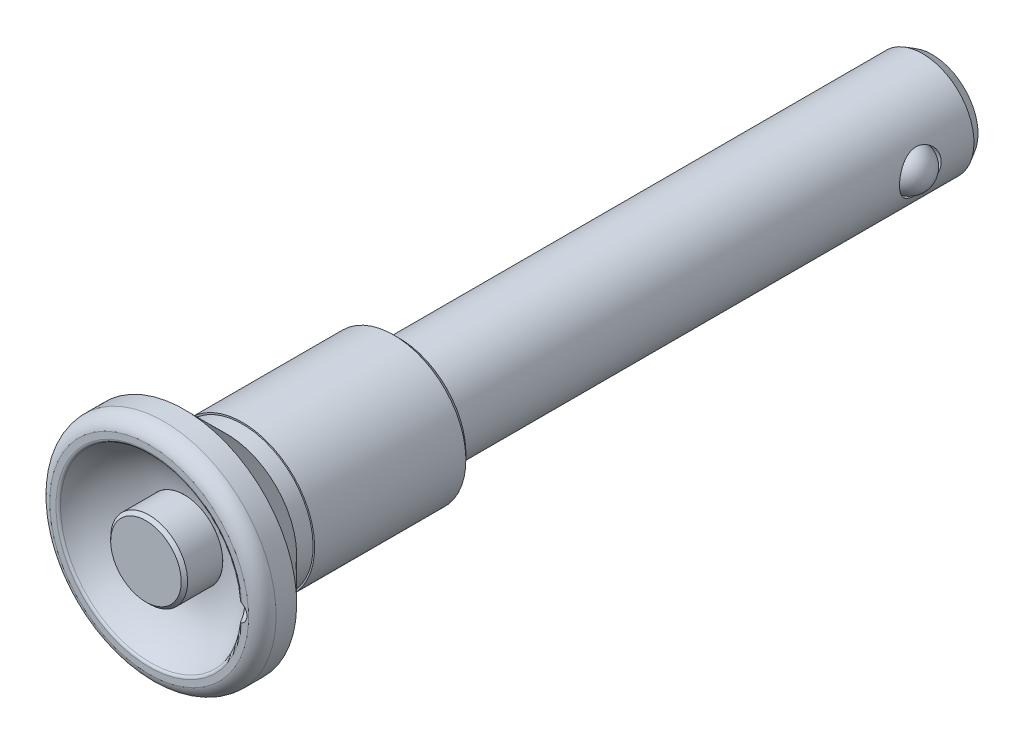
ISO-10303-21;
HEADER;
FILE_DESCRIPTION(('STEP AP214'),'2;1');
FILE_NAME('part.step','',(''),(''),'','','');
FILE_SCHEMA(('AUTOMOTIVE_DESIGN { 1 0 10303 214 1 1 1 1 }'));
ENDSEC;
DATA;
#1=APPLICATION_CONTEXT('core data for automotive mechanical design processes');
#2=APPLICATION_PROTOCOL_DEFINITION('international standard','automotive_design',2000,#1);
#3=PRODUCT_CONTEXT('',#1,'mechanical');
#4=PRODUCT('Part','Part','',(#3));
#5=PRODUCT_RELATED_PRODUCT_CATEGORY('part','',(#4));
#6=PRODUCT_DEFINITION_FORMATION('','',#4);
#7=PRODUCT_DEFINITION_CONTEXT('part definition',#1,'design');
#8=PRODUCT_DEFINITION('design','',#6,#7);
#9=PRODUCT_DEFINITION_SHAPE('','',#8);
#10=(LENGTH_UNIT() NAMED_UNIT(*) SI_UNIT(.MILLI.,.METRE.));
#11=(NAMED_UNIT(*) PLANE_ANGLE_UNIT() SI_UNIT($,.RADIAN.));
#12=(NAMED_UNIT(*) SI_UNIT($,.STERADIAN.) SOLID_ANGLE_UNIT());
#13=UNCERTAINTY_MEASURE_WITH_UNIT(LENGTH_MEASURE(1.E-05),#10,'distance_accuracy_value','');
#14=(GEOMETRIC_REPRESENTATION_CONTEXT(3) GLOBAL_UNCERTAINTY_ASSIGNED_CONTEXT((#13)) GLOBAL_UNIT_ASSIGNED_CONTEXT((#10,
#11,#12)) REPRESENTATION_CONTEXT('',''));
#15=CARTESIAN_POINT('',(0.,0.,0.));
#16=DIRECTION('',(0.,0.,1.));
#17=DIRECTION('',(1.,0.,0.));
#18=AXIS2_PLACEMENT_3D('',#15,#16,#17);
#19=CARTESIAN_POINT('',(9.,0.,-73.25));
#20=DIRECTION('',(1.,0.,0.));
#21=DIRECTION('',(0.,1.,0.));
#22=AXIS2_PLACEMENT_3D('',#19,#20,#21);
#23=CYLINDRICAL_SURFACE('',#22,3.25);
#24=CARTESIAN_POINT('',(-5.63465480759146,3.25,-73.25));
#25=CARTESIAN_POINT('',(-5.63465585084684,3.24999903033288,-73.3347265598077));
#26=CARTESIAN_POINT('',(-5.63657454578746,3.24668003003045,-73.4194635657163));
#27=CARTESIAN_POINT('',(-5.64416687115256,3.23345980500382,-73.5882644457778));
#28=CARTESIAN_POINT('',(-5.64984225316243,3.22355550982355,-73.6723279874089));
#29=CARTESIAN_POINT('',(-5.67225088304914,3.1840842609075,-73.9227685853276));
#30=CARTESIAN_POINT('',(-5.6943660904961,3.14475922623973,-74.0872467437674));
#31=CARTESIAN_POINT('',(-5.7497581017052,3.04227249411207,-74.4053993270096));
#32=CARTESIAN_POINT('',(-5.78297553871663,2.97923736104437,-74.5591260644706));
#33=CARTESIAN_POINT('',(-5.85672343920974,2.83150673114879,-74.8538197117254));
#34=CARTESIAN_POINT('',(-5.89725428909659,2.74681008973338,-74.994785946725));
#35=CARTESIAN_POINT('',(-5.98514477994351,2.54998143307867,-75.2727307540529));
#36=CARTESIAN_POINT('',(-6.03279191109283,2.43616447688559,-75.4084249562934));
#37=CARTESIAN_POINT('',(-6.12722511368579,2.18783002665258,-75.6597995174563));
#38=CARTESIAN_POINT('',(-6.17401074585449,2.05330228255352,-75.7754699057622));
#39=CARTESIAN_POINT('',(-6.26521517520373,1.75630332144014,-75.9911271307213));
#40=CARTESIAN_POINT('',(-6.30926291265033,1.5925609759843,-76.0895350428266));
#41=CARTESIAN_POINT('',(-6.38629670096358,1.24823211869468,-76.2568223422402));
#42=CARTESIAN_POINT('',(-6.41928971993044,1.06765630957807,-76.3257203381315));
#43=CARTESIAN_POINT('',(-6.46842511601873,0.708385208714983,-76.426948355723));
#44=CARTESIAN_POINT('',(-6.48559839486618,0.530468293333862,-76.4615292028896));
#45=CARTESIAN_POINT('',(-6.50500792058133,0.170592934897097,-76.5005535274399));
#46=CARTESIAN_POINT('',(-6.50725319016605,-0.0113630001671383,-76.5050152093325));
#47=CARTESIAN_POINT('',(-6.49704272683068,-0.357230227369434,-76.4845439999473));
#48=CARTESIAN_POINT('',(-6.4858466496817,-0.521336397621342,-76.462129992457));
#49=CARTESIAN_POINT('',(-6.45191454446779,-0.843095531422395,-76.3930510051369));
#50=CARTESIAN_POINT('',(-6.42917765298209,-1.00074801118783,-76.3463842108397));
#51=CARTESIAN_POINT('',(-6.37385308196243,-1.30787680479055,-76.2298199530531));
#52=CARTESIAN_POINT('',(-6.3411333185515,-1.45720962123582,-76.1596096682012));
#53=CARTESIAN_POINT('',(-6.26879358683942,-1.7423345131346,-75.9983862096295));
#54=CARTESIAN_POINT('',(-6.22917114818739,-1.8781217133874,-75.907365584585));
#55=CARTESIAN_POINT('',(-6.14233091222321,-2.14598519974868,-75.6972203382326));
#56=CARTESIAN_POINT('',(-6.09474919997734,-2.27650038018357,-75.5762535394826));
#57=CARTESIAN_POINT('',(-5.99975905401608,-2.51622424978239,-75.3146223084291));
#58=CARTESIAN_POINT('',(-5.95235078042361,-2.62541658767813,-75.1739429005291));
#59=CARTESIAN_POINT('',(-5.85980562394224,-2.82622074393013,-74.8657980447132));
#60=CARTESIAN_POINT('',(-5.81500282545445,-2.91628088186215,-74.6972003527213));
#61=CARTESIAN_POINT('',(-5.75683713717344,-3.02860289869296,-74.4329042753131));
#62=CARTESIAN_POINT('',(-5.73895226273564,-3.06225341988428,-74.3428861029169));
#63=CARTESIAN_POINT('',(-5.70689630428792,-3.12158760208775,-74.1596398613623));
#64=CARTESIAN_POINT('',(-5.69272293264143,-3.14727617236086,-74.0664138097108));
#65=CARTESIAN_POINT('',(-5.66966031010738,-3.18862076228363,-73.8849536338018));
#66=CARTESIAN_POINT('',(-5.66044290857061,-3.2049073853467,-73.7969042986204));
#67=CARTESIAN_POINT('',(-5.64606365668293,-3.23017214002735,-73.6194752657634));
#68=CARTESIAN_POINT('',(-5.64089969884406,-3.23915406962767,-73.5300962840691));
#69=CARTESIAN_POINT('',(-5.63484456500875,-3.24967714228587,-73.3507836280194));
#70=CARTESIAN_POINT('',(-5.63395180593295,-3.25122104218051,-73.2608501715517));
#71=CARTESIAN_POINT('',(-5.63646392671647,-3.24686086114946,-73.0812524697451));
#72=CARTESIAN_POINT('',(-5.63986851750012,-3.24095728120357,-72.9915882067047));
#73=CARTESIAN_POINT('',(-5.65514884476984,-3.21427724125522,-72.7437015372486));
#74=CARTESIAN_POINT('',(-5.67155983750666,-3.18549325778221,-72.5865355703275));
#75=CARTESIAN_POINT('',(-5.71556614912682,-3.10582623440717,-72.2796654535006));
#76=CARTESIAN_POINT('',(-5.74316508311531,-3.05493605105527,-72.1299637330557));
#77=CARTESIAN_POINT('',(-5.80791715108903,-2.93003236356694,-71.8342513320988));
#78=CARTESIAN_POINT('',(-5.84545364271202,-2.85505691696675,-71.6887328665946));
#79=CARTESIAN_POINT('',(-5.92551444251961,-2.68494755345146,-71.4115097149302));
#80=CARTESIAN_POINT('',(-5.96804130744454,-2.58980328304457,-71.2798121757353));
#81=CARTESIAN_POINT('',(-6.0597218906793,-2.36806394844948,-71.0166221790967));
#82=CARTESIAN_POINT('',(-6.10903611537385,-2.23901784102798,-70.8872408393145));
#83=CARTESIAN_POINT('',(-6.20410028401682,-1.9602691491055,-70.6513088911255));
#84=CARTESIAN_POINT('',(-6.24984902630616,-1.81055964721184,-70.5447659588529));
#85=CARTESIAN_POINT('',(-6.33418834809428,-1.48934321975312,-70.3551748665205));
#86=CARTESIAN_POINT('',(-6.3725595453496,-1.31736733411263,-70.272816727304));
#87=CARTESIAN_POINT('',(-6.43615086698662,-0.959533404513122,-70.1390207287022));
#88=CARTESIAN_POINT('',(-6.46138252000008,-0.773687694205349,-70.0875557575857));
#89=CARTESIAN_POINT('',(-6.49401408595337,-0.411781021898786,-70.0214370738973));
#90=CARTESIAN_POINT('',(-6.50283657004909,-0.236384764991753,-70.0038414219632));
#91=CARTESIAN_POINT('',(-6.50610717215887,0.11505074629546,-69.9972911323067));
#92=CARTESIAN_POINT('',(-6.50056030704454,0.29108975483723,-70.0083264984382));
#93=CARTESIAN_POINT('',(-6.47654468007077,0.626628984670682,-70.0567749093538));
#94=CARTESIAN_POINT('',(-6.4589493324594,0.78645569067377,-70.0924062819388));
#95=CARTESIAN_POINT('',(-6.41341105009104,1.09760306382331,-70.1866353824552));
#96=CARTESIAN_POINT('',(-6.38546662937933,1.24892250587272,-70.2452364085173));
#97=CARTESIAN_POINT('',(-6.32026378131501,1.54603651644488,-70.3863521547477));
#98=CARTESIAN_POINT('',(-6.28265782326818,1.69131721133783,-70.4697832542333));
#99=CARTESIAN_POINT('',(-6.20206440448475,1.96642117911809,-70.6570473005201));
#100=CARTESIAN_POINT('',(-6.15907447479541,2.09623730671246,-70.7608896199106));
#101=CARTESIAN_POINT('',(-6.06695065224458,2.35031327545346,-70.9979647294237));
#102=CARTESIAN_POINT('',(-6.01763078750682,2.4727384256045,-71.1330928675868));
#103=CARTESIAN_POINT('',(-5.92193632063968,2.69389263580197,-71.4228073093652));
#104=CARTESIAN_POINT('',(-5.87556434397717,2.79260078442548,-71.5774106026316));
#105=CARTESIAN_POINT('',(-5.81174828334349,2.92195709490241,-71.8239315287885));
#106=CARTESIAN_POINT('',(-5.79116015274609,2.9624334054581,-71.91000421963));
#107=CARTESIAN_POINT('',(-5.7530032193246,3.03586895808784,-72.0859253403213));
#108=CARTESIAN_POINT('',(-5.73543286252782,3.0688320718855,-72.175771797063));
#109=CARTESIAN_POINT('',(-5.70405555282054,3.1267666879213,-72.3583807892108));
#110=CARTESIAN_POINT('',(-5.69023892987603,3.15175875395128,-72.4511351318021));
#111=CARTESIAN_POINT('',(-5.66692413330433,3.19349036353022,-72.6389664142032));
#112=CARTESIAN_POINT('',(-5.65742293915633,3.21023567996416,-72.7340416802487));
#113=CARTESIAN_POINT('',(-5.64512882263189,3.23178897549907,-72.8993457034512));
#114=CARTESIAN_POINT('',(-5.6412106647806,3.23861149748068,-72.9692357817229));
#115=CARTESIAN_POINT('',(-5.63597313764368,3.24771756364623,-73.1094148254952));
#116=CARTESIAN_POINT('',(-5.63465394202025,3.25000080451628,-73.1797038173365));
#117=CARTESIAN_POINT('',(-5.63465480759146,3.25,-73.25));
#118=B_SPLINE_CURVE_WITH_KNOTS('',3,(#24,#25,#26,#27,#28,#29,#30,#31,#32,#33,#34,#35,#36,#37,
#38,#39,#40,#41,#42,#43,#44,#45,#46,#47,#48,#49,#50,#51,#52,#53,#54,#55,#56,#57,#58,#59,#60,#61,
#62,#63,#64,#65,#66,#67,#68,#69,#70,#71,#72,#73,#74,#75,#76,#77,#78,#79,#80,#81,#82,#83,#84,#85,
#86,#87,#88,#89,#90,#91,#92,#93,#94,#95,#96,#97,#98,#99,#100,#101,#102,#103,#104,#105,#106,#107,
#108,#109,#110,#111,#112,#113,#114,#115,#116,#117),.UNSPECIFIED.,.T.,.F.,(4,2,2,2,2,2,2,2,2,2,2,
2,2,2,2,2,2,2,2,2,2,2,2,2,2,2,2,2,2,2,2,2,2,2,2,2,2,2,2,2,2,2,2,2,2,2,4),(0.,0.254102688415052,
0.508323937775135,1.01720671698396,1.52341076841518,2.02964157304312,2.57756086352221,
3.1257522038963,3.71082834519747,4.29553499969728,4.83868787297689,5.38151242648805,
5.87719988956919,6.37292444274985,6.87551542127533,7.37828663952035,7.9285322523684,
8.47919817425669,9.06474424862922,9.35763698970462,9.65034877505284,9.92001687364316,
10.1895446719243,10.4589725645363,10.7283823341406,11.2078563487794,11.6874854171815,
12.189332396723,12.6914376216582,13.2567245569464,13.8222011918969,14.4025190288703,
14.982326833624,15.5089851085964,16.0354595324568,16.5273252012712,17.0192615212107,
17.5322584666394,18.045491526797,18.6097361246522,19.1744764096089,19.4660899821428,
19.7575529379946,20.0482577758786,20.3387588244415,20.5495694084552,20.7603940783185),.UNSPECIFIED.);
#119=CARTESIAN_POINT('',(-6.04146080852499,-2.41093054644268,-75.429429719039));
#120=VERTEX_POINT('',#119);
#121=CARTESIAN_POINT('',(-6.04146080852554,2.41093054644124,-75.4294297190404));
#122=VERTEX_POINT('',#121);
#123=EDGE_CURVE('E78',#120,#122,#118,.T.);
#124=ORIENTED_EDGE('',*,*,#123,.F.);
#125=CARTESIAN_POINT('',(-6.50475478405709,0.,-76.5));
#126=CARTESIAN_POINT('',(-6.50475472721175,-0.182431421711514,-76.4999918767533));
#127=CARTESIAN_POINT('',(-6.50415200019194,-0.364995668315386,-76.4845876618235));
#128=CARTESIAN_POINT('',(-6.50173100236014,-0.725096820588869,-76.4233526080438));
#129=CARTESIAN_POINT('',(-6.49991125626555,-0.902627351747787,-76.3774848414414));
#130=CARTESIAN_POINT('',(-6.4950278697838,-1.24739374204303,-76.2566336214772));
#131=CARTESIAN_POINT('',(-6.49196480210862,-1.41463430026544,-76.1816635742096));
#132=CARTESIAN_POINT('',(-6.4845405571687,-1.73409069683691,-76.0047703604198));
#133=CARTESIAN_POINT('',(-6.4801797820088,-1.88631116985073,-75.9028555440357));
#134=CARTESIAN_POINT('',(-6.47005616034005,-2.17150162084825,-75.6749545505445));
#135=CARTESIAN_POINT('',(-6.46429309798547,-2.30446863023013,-75.5489646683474));
#136=CARTESIAN_POINT('',(-6.4511789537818,-2.54740669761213,-75.2764608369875));
#137=CARTESIAN_POINT('',(-6.44382727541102,-2.65736908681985,-75.1299391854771));
#138=CARTESIAN_POINT('',(-6.42714023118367,-2.8512229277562,-74.8204831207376));
#139=CARTESIAN_POINT('',(-6.41780288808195,-2.935088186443,-74.6575324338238));
#140=CARTESIAN_POINT('',(-6.39637595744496,-3.07415122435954,-74.3201765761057));
#141=CARTESIAN_POINT('',(-6.38429049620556,-3.12939158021,-74.1457888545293));
#142=CARTESIAN_POINT('',(-6.36213145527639,-3.18943231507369,-73.8809438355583));
#143=CARTESIAN_POINT('',(-6.35414445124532,-3.20560626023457,-73.7927604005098));
#144=CARTESIAN_POINT('',(-6.33542581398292,-3.23060141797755,-73.6156617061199));
#145=CARTESIAN_POINT('',(-6.3246946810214,-3.239423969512,-73.5267465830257));
#146=CARTESIAN_POINT('',(-6.30342598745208,-3.24711535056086,-73.3937912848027));
#147=CARTESIAN_POINT('',(-6.29549176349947,-3.24875723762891,-73.3496150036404));
#148=CARTESIAN_POINT('',(-6.2788294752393,-3.24969197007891,-73.2959956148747));
#149=CARTESIAN_POINT('',(-6.27515773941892,-3.24982305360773,-73.2853466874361));
#150=CARTESIAN_POINT('',(-6.26890017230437,-3.24992109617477,-73.2727940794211));
#151=CARTESIAN_POINT('',(-6.26755615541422,-3.24993748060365,-73.2703066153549));
#152=CARTESIAN_POINT('',(-6.26457757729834,-3.24996385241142,-73.2655076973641));
#153=CARTESIAN_POINT('',(-6.26294427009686,-3.24997386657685,-73.2631955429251));
#154=CARTESIAN_POINT('',(-6.26029966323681,-3.2499838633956,-73.2602771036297));
#155=CARTESIAN_POINT('',(-6.25950365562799,-3.24998625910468,-73.259480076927));
#156=CARTESIAN_POINT('',(-6.25780472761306,-3.24999021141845,-73.2580094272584));
#157=CARTESIAN_POINT('',(-6.25690222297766,-3.24999177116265,-73.2573353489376));
#158=CARTESIAN_POINT('',(-6.25538170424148,-3.24999365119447,-73.2564327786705));
#159=CARTESIAN_POINT('',(-6.25480452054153,-3.2499942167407,-73.2561363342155));
#160=CARTESIAN_POINT('',(-6.25361148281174,-3.2499951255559,-73.2556343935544));
#161=CARTESIAN_POINT('',(-6.25299567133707,-3.24999546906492,-73.2554287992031));
#162=CARTESIAN_POINT('',(-6.25172949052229,-3.2499959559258,-73.2551293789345));
#163=CARTESIAN_POINT('',(-6.25107882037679,-3.24999609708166,-73.2550367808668));
#164=CARTESIAN_POINT('',(-6.24977202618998,-3.24999618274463,-73.2549813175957));
#165=CARTESIAN_POINT('',(-6.24911590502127,-3.24999612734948,-73.2550183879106));
#166=CARTESIAN_POINT('',(-6.24790373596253,-3.24999583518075,-73.2552035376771));
#167=CARTESIAN_POINT('',(-6.2473453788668,-3.24999562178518,-73.2553372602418));
#168=CARTESIAN_POINT('',(-6.2462549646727,-3.24999503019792,-73.2556861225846));
#169=CARTESIAN_POINT('',(-6.24572292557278,-3.24999465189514,-73.2559013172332));
#170=CARTESIAN_POINT('',(-6.24435696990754,-3.24999341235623,-73.2565561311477));
#171=CARTESIAN_POINT('',(-6.24354975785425,-3.24999239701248,-73.2570509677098));
#172=CARTESIAN_POINT('',(-6.24201857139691,-3.24998981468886,-73.2581558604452));
#173=CARTESIAN_POINT('',(-6.24129488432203,-3.24998824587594,-73.2587662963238));
#174=CARTESIAN_POINT('',(-6.23885580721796,-3.24998160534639,-73.2610537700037));
#175=CARTESIAN_POINT('',(-6.23732819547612,-3.24997485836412,-73.2629265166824));
#176=CARTESIAN_POINT('',(-6.23453858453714,-3.24995689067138,-73.2668604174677));
#177=CARTESIAN_POINT('',(-6.23327848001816,-3.24994563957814,-73.2689227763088));
#178=CARTESIAN_POINT('',(-6.22754077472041,-3.24987933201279,-73.2791362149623));
#179=CARTESIAN_POINT('',(-6.22414293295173,-3.24979089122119,-73.2878680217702));
#180=CARTESIAN_POINT('',(-6.21809518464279,-3.24953787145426,-73.3055431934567));
#181=CARTESIAN_POINT('',(-6.21544772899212,-3.24937304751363,-73.3144871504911));
#182=CARTESIAN_POINT('',(-6.20329024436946,-3.24836406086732,-73.359005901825));
#183=CARTESIAN_POINT('',(-6.19656627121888,-3.24694993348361,-73.3953332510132));
#184=CARTESIAN_POINT('',(-6.18452276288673,-3.24287823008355,-73.4681644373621));
#185=CARTESIAN_POINT('',(-6.17920844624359,-3.24021613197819,-73.5046684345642));
#186=CARTESIAN_POINT('',(-6.16455650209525,-3.23031427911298,-73.6146776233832));
#187=CARTESIAN_POINT('',(-6.15659209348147,-3.22116857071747,-73.6882307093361));
#188=CARTESIAN_POINT('',(-6.14213641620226,-3.19786349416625,-73.8345240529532));
#189=CARTESIAN_POINT('',(-6.13564314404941,-3.1837110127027,-73.907265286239));
#190=CARTESIAN_POINT('',(-6.11756290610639,-3.13371051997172,-74.1243002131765));
#191=CARTESIAN_POINT('',(-6.10741258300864,-3.09035068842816,-74.2670577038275));
#192=CARTESIAN_POINT('',(-6.08705596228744,-2.9725018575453,-74.5766439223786));
#193=CARTESIAN_POINT('',(-6.07734814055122,-2.89321109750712,-74.7416864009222));
#194=CARTESIAN_POINT('',(-6.06000127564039,-2.70803402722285,-75.0561997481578));
#195=CARTESIAN_POINT('',(-6.05236213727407,-2.60214894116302,-75.2056713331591));
#196=CARTESIAN_POINT('',(-6.0387139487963,-2.36675113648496,-75.484797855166));
#197=CARTESIAN_POINT('',(-6.0327050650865,-2.23723600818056,-75.6144507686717));
#198=CARTESIAN_POINT('',(-6.02211352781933,-1.95825322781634,-75.8502113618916));
#199=CARTESIAN_POINT('',(-6.01753088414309,-1.80878543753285,-75.9563188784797));
#200=CARTESIAN_POINT('',(-6.00967850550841,-1.4941417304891,-76.1419551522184));
#201=CARTESIAN_POINT('',(-6.00640873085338,-1.32896628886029,-76.2214847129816));
#202=CARTESIAN_POINT('',(-6.00112064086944,-0.987593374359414,-76.3516982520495));
#203=CARTESIAN_POINT('',(-5.99910232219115,-0.811395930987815,-76.4023823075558));
#204=CARTESIAN_POINT('',(-5.99628586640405,-0.453052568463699,-76.4734446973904));
#205=CARTESIAN_POINT('',(-5.99548726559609,-0.270908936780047,-76.4938345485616));
#206=CARTESIAN_POINT('',(-5.99509745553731,0.0942183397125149,-76.5037635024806));
#207=CARTESIAN_POINT('',(-5.99550624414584,0.277201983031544,-76.4933026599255));
#208=CARTESIAN_POINT('',(-5.99753672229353,0.638781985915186,-76.4418331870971));
#209=CARTESIAN_POINT('',(-5.99915820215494,0.817379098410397,-76.4008298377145));
#210=CARTESIAN_POINT('',(-6.00363843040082,1.16515467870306,-76.2894496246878));
#211=CARTESIAN_POINT('',(-6.00649721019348,1.33433290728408,-76.2190720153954));
#212=CARTESIAN_POINT('',(-6.01350251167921,1.65849568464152,-76.0509346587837));
#213=CARTESIAN_POINT('',(-6.01764926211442,1.81347770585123,-75.9531700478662));
#214=CARTESIAN_POINT('',(-6.02732342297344,2.1047933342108,-75.7330763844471));
#215=CARTESIAN_POINT('',(-6.03285058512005,2.24113028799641,-75.6107517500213));
#216=CARTESIAN_POINT('',(-6.04544982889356,2.49132905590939,-75.3450117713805));
#217=CARTESIAN_POINT('',(-6.05252187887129,2.60519133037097,-75.2015968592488));
#218=CARTESIAN_POINT('',(-6.06857069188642,2.80731713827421,-74.8976741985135));
#219=CARTESIAN_POINT('',(-6.07754918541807,2.89555724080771,-74.7371509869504));
#220=CARTESIAN_POINT('',(-6.09807707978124,3.04397016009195,-74.4033061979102));
#221=CARTESIAN_POINT('',(-6.10963108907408,3.10409205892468,-74.2299620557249));
#222=CARTESIAN_POINT('',(-6.13064936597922,3.17169375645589,-73.9649701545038));
#223=CARTESIAN_POINT('',(-6.13825974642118,3.19045596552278,-73.8759096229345));
#224=CARTESIAN_POINT('',(-6.15556946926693,3.22042544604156,-73.6967504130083));
#225=CARTESIAN_POINT('',(-6.16526748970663,3.23163748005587,-73.6066524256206));
#226=CARTESIAN_POINT('',(-6.18408699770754,3.24288271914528,-73.4699792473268));
#227=CARTESIAN_POINT('',(-6.19122596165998,3.24569959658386,-73.4233942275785));
#228=CARTESIAN_POINT('',(-6.20522823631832,3.24841427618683,-73.3541203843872));
#229=CARTESIAN_POINT('',(-6.21044556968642,3.2490673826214,-73.3311266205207));
#230=CARTESIAN_POINT('',(-6.22071764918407,3.24967689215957,-73.2971645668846));
#231=CARTESIAN_POINT('',(-6.22455261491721,3.24981834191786,-73.2859249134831));
#232=CARTESIAN_POINT('',(-6.23115042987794,3.24992193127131,-73.2726935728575));
#233=CARTESIAN_POINT('',(-6.23257343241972,3.24993908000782,-73.2700667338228));
#234=CARTESIAN_POINT('',(-6.23574861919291,3.249966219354,-73.2650204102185));
#235=CARTESIAN_POINT('',(-6.2374982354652,3.24997626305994,-73.2625995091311));
#236=CARTESIAN_POINT('',(-6.24023323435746,3.24998546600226,-73.259747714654));
#237=CARTESIAN_POINT('',(-6.24095037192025,3.24998741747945,-73.2590662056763));
#238=CARTESIAN_POINT('',(-6.24247036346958,3.2499906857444,-73.2578055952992));
#239=CARTESIAN_POINT('',(-6.24327303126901,3.24999200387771,-73.2572262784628));
#240=CARTESIAN_POINT('',(-6.24469100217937,3.24999372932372,-73.2563932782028));
#241=CARTESIAN_POINT('',(-6.24527994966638,3.24999429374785,-73.2560953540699));
#242=CARTESIAN_POINT('',(-6.24649738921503,3.24999519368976,-73.2555949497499));
#243=CARTESIAN_POINT('',(-6.24712582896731,3.24999552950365,-73.2553923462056));
#244=CARTESIAN_POINT('',(-6.24841731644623,3.24999599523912,-73.2551042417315));
#245=CARTESIAN_POINT('',(-6.24908067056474,3.24999612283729,-73.2550200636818));
#246=CARTESIAN_POINT('',(-6.25041071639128,3.24999617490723,-73.2549864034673));
#247=CARTESIAN_POINT('',(-6.25107740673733,3.24999609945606,-73.2550368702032));
#248=CARTESIAN_POINT('',(-6.2522960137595,3.24999576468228,-73.2552474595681));
#249=CARTESIAN_POINT('',(-6.25285091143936,3.24999553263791,-73.2553912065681));
#250=CARTESIAN_POINT('',(-6.2539333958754,3.24999490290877,-73.2557583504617));
#251=CARTESIAN_POINT('',(-6.25446096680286,3.24999450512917,-73.2559817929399));
#252=CARTESIAN_POINT('',(-6.25583840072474,3.24999318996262,-73.256667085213));
#253=CARTESIAN_POINT('',(-6.25665912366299,3.24999210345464,-73.2571869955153));
#254=CARTESIAN_POINT('',(-6.2582140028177,3.24998934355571,-73.2583432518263));
#255=CARTESIAN_POINT('',(-6.2589478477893,3.24998766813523,-73.2589799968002));
#256=CARTESIAN_POINT('',(-6.26145971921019,3.24998046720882,-73.2613987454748));
#257=CARTESIAN_POINT('',(-6.26303482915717,3.2499730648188,-73.2633865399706));
#258=CARTESIAN_POINT('',(-6.26590679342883,3.24995329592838,-73.2675538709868));
#259=CARTESIAN_POINT('',(-6.26720163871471,3.24994089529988,-73.269734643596));
#260=CARTESIAN_POINT('',(-6.27320326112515,3.24986641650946,-73.2807202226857));
#261=CARTESIAN_POINT('',(-6.27673982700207,3.24976552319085,-73.2901364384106));
#262=CARTESIAN_POINT('',(-6.28303094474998,3.24947572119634,-73.3091775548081));
#263=CARTESIAN_POINT('',(-6.28578309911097,3.24928654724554,-73.3188030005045));
#264=CARTESIAN_POINT('',(-6.29841795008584,3.24812694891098,-73.3667085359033));
#265=CARTESIAN_POINT('',(-6.30538389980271,3.24649816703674,-73.4057506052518));
#266=CARTESIAN_POINT('',(-6.31786268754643,3.24180659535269,-73.4839948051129));
#267=CARTESIAN_POINT('',(-6.32337031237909,3.23873876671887,-73.5231970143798));
#268=CARTESIAN_POINT('',(-6.33857182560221,3.22731083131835,-73.6414665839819));
#269=CARTESIAN_POINT('',(-6.3468294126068,3.21674112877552,-73.7205459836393));
#270=CARTESIAN_POINT('',(-6.36180806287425,3.18980788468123,-73.8776933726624));
#271=CARTESIAN_POINT('',(-6.36853100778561,3.17345150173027,-73.9557624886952));
#272=CARTESIAN_POINT('',(-6.38722831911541,3.11568291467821,-74.1883617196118));
#273=CARTESIAN_POINT('',(-6.39769866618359,3.06560179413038,-74.3409675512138));
#274=CARTESIAN_POINT('',(-6.41649095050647,2.94356822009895,-74.6369097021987));
#275=CARTESIAN_POINT('',(-6.42481661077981,2.87165414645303,-74.7802617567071));
#276=CARTESIAN_POINT('',(-6.43988100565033,2.70750791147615,-75.0548470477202));
#277=CARTESIAN_POINT('',(-6.44662026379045,2.61528247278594,-75.1860842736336));
#278=CARTESIAN_POINT('',(-6.45968563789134,2.39819149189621,-75.4510135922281));
#279=CARTESIAN_POINT('',(-6.46582082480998,2.27056101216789,-75.58246220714));
#280=CARTESIAN_POINT('',(-6.47665599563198,1.99493696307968,-75.82218121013));
#281=CARTESIAN_POINT('',(-6.48135496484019,1.84692910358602,-75.9304351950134));
#282=CARTESIAN_POINT('',(-6.48943298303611,1.53479241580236,-76.1205971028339));
#283=CARTESIAN_POINT('',(-6.49281172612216,1.37065986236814,-76.2024989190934));
#284=CARTESIAN_POINT('',(-6.49830922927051,1.03110256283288,-76.3374958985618));
#285=CARTESIAN_POINT('',(-6.50042961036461,0.855692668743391,-76.3906281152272));
#286=CARTESIAN_POINT('',(-6.50287966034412,0.565964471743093,-76.4523665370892));
#287=CARTESIAN_POINT('',(-6.50358302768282,0.453533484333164,-76.4702066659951));
#288=CARTESIAN_POINT('',(-6.50452060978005,0.227418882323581,-76.4940259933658));
#289=CARTESIAN_POINT('',(-6.50475481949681,0.113735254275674,-76.5000050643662));
#290=CARTESIAN_POINT('',(-6.50475478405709,0.,-76.5));
#291=B_SPLINE_CURVE_WITH_KNOTS('',3,(#125,#126,#127,#128,#129,#130,#131,#132,#133,#134,#135,
#136,#137,#138,#139,#140,#141,#142,#143,#144,#145,#146,#147,#148,#149,#150,#151,#152,#153,#154,
#155,#156,#157,#158,#159,#160,#161,#162,#163,#164,#165,#166,#167,#168,#169,#170,#171,#172,#173,
#174,#175,#176,#177,#178,#179,#180,#181,#182,#183,#184,#185,#186,#187,#188,#189,#190,#191,#192,
#193,#194,#195,#196,#197,#198,#199,#200,#201,#202,#203,#204,#205,#206,#207,#208,#209,#210,#211,
#212,#213,#214,#215,#216,#217,#218,#219,#220,#221,#222,#223,#224,#225,#226,#227,#228,#229,#230,
#231,#232,#233,#234,#235,#236,#237,#238,#239,#240,#241,#242,#243,#244,#245,#246,#247,#248,#249,
#250,#251,#252,#253,#254,#255,#256,#257,#258,#259,#260,#261,#262,#263,#264,#265,#266,#267,#268,
#269,#270,#271,#272,#273,#274,#275,#276,#277,#278,#279,#280,#281,#282,#283,#284,#285,#286,#287,
#288,#289,#290),.UNSPECIFIED.,.T.,.F.,(4,2,2,2,2,2,2,2,2,2,2,2,2,2,2,2,2,2,2,2,2,2,2,2,2,2,2,2,
2,2,2,2,2,2,2,2,2,2,2,2,2,2,2,2,2,2,2,2,2,2,2,2,2,2,2,2,2,2,2,2,2,2,2,2,2,2,2,2,2,2,2,2,2,2,2,2,
2,2,2,2,2,2,4),(0.,0.546878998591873,1.09442213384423,1.64171333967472,2.18883513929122,
2.73604120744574,3.28345310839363,3.83141267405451,4.37855484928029,4.64829359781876,
4.91798320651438,5.05238497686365,5.08600715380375,5.09448207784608,5.10292112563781,
5.10629355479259,5.10965322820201,5.11159396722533,5.11353260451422,5.11549212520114,
5.11745067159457,5.11916600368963,5.12088249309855,5.12370644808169,5.12653984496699,
5.13373370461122,5.14097693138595,5.16888967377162,5.19689256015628,5.30747569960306,
5.41846267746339,5.64180446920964,5.86484024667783,6.31195514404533,6.85939401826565,
7.40680769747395,7.95427723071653,8.50175055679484,9.04920732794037,9.59666263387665,
10.1439097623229,10.6911559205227,11.2383074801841,11.7854729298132,12.3327356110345,
12.879899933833,13.427053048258,13.9747049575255,14.5233447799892,14.7970709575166,
15.0706243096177,15.2120965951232,15.2828520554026,15.3182754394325,15.3272316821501,
15.3361202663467,15.3390824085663,15.3420382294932,15.3440119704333,15.3459831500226,
15.3479761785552,15.3499684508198,15.3516812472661,15.3533950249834,15.3562927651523,
15.3592005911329,15.3667496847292,15.3743512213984,15.4043178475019,15.4343751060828,
15.5531053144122,15.6722543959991,15.9125314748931,16.1525123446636,16.6334226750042,
17.113492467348,17.5934036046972,18.1407106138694,18.688403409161,19.2362230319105,
19.7833354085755,20.1242786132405,20.465225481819),.UNSPECIFIED.);
#292=EDGE_CURVE('E62',#122,#120,#291,.T.);
#293=ORIENTED_EDGE('',*,*,#292,.F.);
#294=EDGE_LOOP('',(#124,#293));
#295=FACE_BOUND('',#294,.T.);
#296=CARTESIAN_POINT('',(-7.31009575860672,3.25,-73.25));
#297=CARTESIAN_POINT('',(-7.31009732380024,3.24999819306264,-73.1630599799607));
#298=CARTESIAN_POINT('',(-7.31165386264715,3.24650411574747,-73.076090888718));
#299=CARTESIAN_POINT('',(-7.31782159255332,3.23257358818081,-72.9028024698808));
#300=CARTESIAN_POINT('',(-7.32243471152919,3.22213275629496,-72.8164835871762));
#301=CARTESIAN_POINT('',(-7.34068494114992,3.18046303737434,-72.5591175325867));
#302=CARTESIAN_POINT('',(-7.35873227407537,3.13888730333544,-72.3899262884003));
#303=CARTESIAN_POINT('',(-7.40417815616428,3.03010582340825,-72.0622642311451));
#304=CARTESIAN_POINT('',(-7.43153982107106,2.96300104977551,-71.9037540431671));
#305=CARTESIAN_POINT('',(-7.49246721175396,2.80536216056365,-71.6002509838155));
#306=CARTESIAN_POINT('',(-7.5260312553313,2.71483439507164,-71.4552544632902));
#307=CARTESIAN_POINT('',(-7.59780469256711,2.50719740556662,-71.174284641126));
#308=CARTESIAN_POINT('',(-7.6361666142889,2.38892405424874,-71.0392107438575));
#309=CARTESIAN_POINT('',(-7.7119557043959,2.13160039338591,-70.7901513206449));
#310=CARTESIAN_POINT('',(-7.74938251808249,1.99254233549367,-70.676173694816));
#311=CARTESIAN_POINT('',(-7.82092244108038,1.69061377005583,-70.4680431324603));
#312=CARTESIAN_POINT('',(-7.85483757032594,1.52700226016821,-70.3748909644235));
#313=CARTESIAN_POINT('',(-7.91367836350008,1.18480623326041,-70.2178173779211));
#314=CARTESIAN_POINT('',(-7.93860783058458,1.00622809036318,-70.1538835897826));
#315=CARTESIAN_POINT('',(-7.97558858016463,0.648594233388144,-70.0602869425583));
#316=CARTESIAN_POINT('',(-7.98821898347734,0.470004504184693,-70.0290769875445));
#317=CARTESIAN_POINT('',(-8.00127556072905,0.109705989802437,-69.9968257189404));
#318=CARTESIAN_POINT('',(-8.00170642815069,-0.0720015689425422,-69.9957728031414));
#319=CARTESIAN_POINT('',(-7.99066355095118,-0.422169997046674,-70.0230312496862));
#320=CARTESIAN_POINT('',(-7.97987772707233,-0.590788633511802,-70.0496457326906));
#321=CARTESIAN_POINT('',(-7.94854711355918,-0.920926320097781,-70.1285888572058));
#322=CARTESIAN_POINT('',(-7.92800160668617,-1.08244484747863,-70.1809193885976));
#323=CARTESIAN_POINT('',(-7.87875951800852,-1.39673026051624,-70.3104453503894));
#324=CARTESIAN_POINT('',(-7.84994411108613,-1.54932739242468,-70.3880056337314));
#325=CARTESIAN_POINT('',(-7.78700709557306,-1.83973693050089,-70.5654420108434));
#326=CARTESIAN_POINT('',(-7.75288364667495,-1.97754418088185,-70.6653258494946));
#327=CARTESIAN_POINT('',(-7.68006213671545,-2.2443353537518,-70.8924212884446));
#328=CARTESIAN_POINT('',(-7.6412107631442,-2.37209684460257,-71.0210218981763));
#329=CARTESIAN_POINT('',(-7.56507027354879,-2.60475126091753,-71.2979515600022));
#330=CARTESIAN_POINT('',(-7.52778170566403,-2.70963621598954,-71.4462874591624));
#331=CARTESIAN_POINT('',(-7.45792668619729,-2.89648137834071,-71.7641116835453));
#332=CARTESIAN_POINT('',(-7.42553491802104,-2.97766171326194,-71.9341001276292));
#333=CARTESIAN_POINT('',(-7.37120049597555,-3.10975325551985,-72.2870012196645));
#334=CARTESIAN_POINT('',(-7.34925080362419,-3.16068485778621,-72.4699050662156));
#335=CARTESIAN_POINT('',(-7.32000769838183,-3.22780941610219,-72.8312282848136));
#336=CARTESIAN_POINT('',(-7.31188362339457,-3.24597550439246,-73.0092128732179));
#337=CARTESIAN_POINT('',(-7.30884184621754,-3.25282336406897,-73.365834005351));
#338=CARTESIAN_POINT('',(-7.31391993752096,-3.24151452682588,-73.544470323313));
#339=CARTESIAN_POINT('',(-7.33585566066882,-3.19153169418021,-73.8861339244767));
#340=CARTESIAN_POINT('',(-7.35199401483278,-3.15452692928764,-74.0494573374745));
#341=CARTESIAN_POINT('',(-7.39332962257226,-3.05638531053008,-74.3674592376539));
#342=CARTESIAN_POINT('',(-7.41852892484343,-2.99524299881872,-74.522135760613));
#343=CARTESIAN_POINT('',(-7.47641704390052,-2.84775217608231,-74.8255746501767));
#344=CARTESIAN_POINT('',(-7.50937194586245,-2.76046786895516,-74.9738297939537));
#345=CARTESIAN_POINT('',(-7.57866264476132,-2.56411776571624,-75.2542780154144));
#346=CARTESIAN_POINT('',(-7.61499984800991,-2.4550428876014,-75.3864643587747));
#347=CARTESIAN_POINT('',(-7.69032288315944,-2.20834452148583,-75.6415580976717));
#348=CARTESIAN_POINT('',(-7.72929827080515,-2.0691737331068,-75.7629779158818));
#349=CARTESIAN_POINT('',(-7.80289864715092,-1.7715109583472,-75.980984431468));
#350=CARTESIAN_POINT('',(-7.83752340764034,-1.6130179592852,-76.0775698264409));
#351=CARTESIAN_POINT('',(-7.89867149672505,-1.28045225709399,-76.2428966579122));
#352=CARTESIAN_POINT('',(-7.9251887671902,-1.10636802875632,-76.311617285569));
#353=CARTESIAN_POINT('',(-7.9670167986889,-0.747763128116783,-76.4183263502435));
#354=CARTESIAN_POINT('',(-7.98233386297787,-0.563248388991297,-76.4563320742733));
#355=CARTESIAN_POINT('',(-7.99934332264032,-0.202353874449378,-76.4984343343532));
#356=CARTESIAN_POINT('',(-8.00187969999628,-0.0262571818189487,-76.5046318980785));
#357=CARTESIAN_POINT('',(-7.99534247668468,0.324389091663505,-76.4885273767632));
#358=CARTESIAN_POINT('',(-7.98627073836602,0.498938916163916,-76.4662298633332));
#359=CARTESIAN_POINT('',(-7.95796712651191,0.835717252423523,-76.3952733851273));
#360=CARTESIAN_POINT('',(-7.93907454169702,0.998161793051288,-76.3474934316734));
#361=CARTESIAN_POINT('',(-7.89317001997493,1.31268916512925,-76.2278639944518));
#362=CARTESIAN_POINT('',(-7.86615650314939,1.464769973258,-76.1560098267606));
#363=CARTESIAN_POINT('',(-7.80514921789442,1.76171759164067,-75.9866698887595));
#364=CARTESIAN_POINT('',(-7.77089769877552,1.90595939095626,-75.8881831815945));
#365=CARTESIAN_POINT('',(-7.69951725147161,2.176473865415,-75.6698538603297));
#366=CARTESIAN_POINT('',(-7.66238732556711,2.30274026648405,-75.5500038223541));
#367=CARTESIAN_POINT('',(-7.5864657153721,2.54210677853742,-75.2833069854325));
#368=CARTESIAN_POINT('',(-7.54772000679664,2.65384474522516,-75.1352223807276));
#369=CARTESIAN_POINT('',(-7.47545536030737,2.85108049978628,-74.8210469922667));
#370=CARTESIAN_POINT('',(-7.44193927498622,2.93656399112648,-74.6549464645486));
#371=CARTESIAN_POINT('',(-7.3989625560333,3.04249490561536,-74.3964499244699));
#372=CARTESIAN_POINT('',(-7.38588609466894,3.07401827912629,-74.3090459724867));
#373=CARTESIAN_POINT('',(-7.36253208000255,3.12954209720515,-74.1315309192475));
#374=CARTESIAN_POINT('',(-7.35225317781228,3.15354616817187,-74.0414211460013));
#375=CARTESIAN_POINT('',(-7.3348971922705,3.19370630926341,-73.8594307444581));
#376=CARTESIAN_POINT('',(-7.32781154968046,3.20988336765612,-73.7675555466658));
#377=CARTESIAN_POINT('',(-7.31707726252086,3.23427923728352,-73.5826022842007));
#378=CARTESIAN_POINT('',(-7.31342609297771,3.24250389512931,-73.4895251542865));
#379=CARTESIAN_POINT('',(-7.31058346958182,3.24890274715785,-73.3475459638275));
#380=CARTESIAN_POINT('',(-7.31009488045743,3.25000101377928,-73.2987775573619));
#381=CARTESIAN_POINT('',(-7.31009575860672,3.25,-73.25));
#382=B_SPLINE_CURVE_WITH_KNOTS('',3,(#296,#297,#298,#299,#300,#301,#302,#303,#304,#305,#306,
#307,#308,#309,#310,#311,#312,#313,#314,#315,#316,#317,#318,#319,#320,#321,#322,#323,#324,#325,
#326,#327,#328,#329,#330,#331,#332,#333,#334,#335,#336,#337,#338,#339,#340,#341,#342,#343,#344,
#345,#346,#347,#348,#349,#350,#351,#352,#353,#354,#355,#356,#357,#358,#359,#360,#361,#362,#363,
#364,#365,#366,#367,#368,#369,#370,#371,#372,#373,#374,#375,#376,#377,#378,#379,#380,#381),
.UNSPECIFIED.,.T.,.F.,(4,2,2,2,2,2,2,2,2,2,2,2,2,2,2,2,2,2,2,2,2,2,2,2,2,2,2,2,2,2,2,2,2,2,2,2,
2,2,2,2,2,2,4),(0.,0.260777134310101,0.521718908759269,1.04438772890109,1.56501043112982,
2.08549213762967,2.63385451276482,3.18242182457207,3.75341190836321,4.32416003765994,
4.86650613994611,5.40864358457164,5.91938723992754,6.43016843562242,6.94869149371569,
7.46739472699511,8.02109099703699,8.57497987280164,9.14544243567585,9.71551993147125,
10.2499491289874,10.7842080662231,11.2866605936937,11.7892267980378,12.3125257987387,
12.8360433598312,13.3996836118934,13.9633534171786,14.5274433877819,15.0912156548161,
15.6172206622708,16.1431412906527,16.6519938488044,17.1609454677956,17.6926147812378,
18.2244692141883,18.7904042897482,19.3566469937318,19.6378242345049,19.9188656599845,
20.1991492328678,20.4792265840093,20.6255351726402),.UNSPECIFIED.);
#383=CARTESIAN_POINT('',(-7.31009575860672,3.25,-73.25));
#384=VERTEX_POINT('',#383);
#385=EDGE_CURVE('E69',#384,#384,#382,.T.);
#386=ORIENTED_EDGE('',*,*,#385,.F.);
#387=EDGE_LOOP('',(#386));
#388=FACE_BOUND('',#387,.T.);
#389=ADVANCED_FACE('F14',(#295,#388),#23,.F.);
#390=CARTESIAN_POINT('',(0.,0.,-83.1));
#391=DIRECTION('',(0.,0.,-1.));
#392=DIRECTION('',(0.,1.,0.));
#393=AXIS2_PLACEMENT_3D('',#390,#391,#392);
#394=CYLINDRICAL_SURFACE('',#393,3.);
#395=CARTESIAN_POINT('',(0.,0.,-77.6));
#396=DIRECTION('',(0.,0.,-1.));
#397=DIRECTION('',(0.,1.,0.));
#398=AXIS2_PLACEMENT_3D('',#395,#396,#397);
#399=CIRCLE('',#398,3.);
#400=CARTESIAN_POINT('',(0.,3.,-77.6));
#401=VERTEX_POINT('',#400);
#402=EDGE_CURVE('E9',#401,#401,#399,.T.);
#403=ORIENTED_EDGE('',*,*,#402,.F.);
#404=EDGE_LOOP('',(#403));
#405=FACE_BOUND('',#404,.T.);
#406=CARTESIAN_POINT('',(0.,0.,-83.1));
#407=DIRECTION('',(0.,0.,-1.));
#408=DIRECTION('',(0.,1.,0.));
#409=AXIS2_PLACEMENT_3D('',#406,#407,#408);
#410=CIRCLE('',#409,3.);
#411=CARTESIAN_POINT('',(0.,3.,-83.1));
#412=VERTEX_POINT('',#411);
#413=EDGE_CURVE('E307',#412,#412,#410,.T.);
#414=ORIENTED_EDGE('',*,*,#413,.T.);
#415=EDGE_LOOP('',(#414));
#416=FACE_BOUND('',#415,.T.);
#417=ADVANCED_FACE('F272',(#405,#416),#394,.F.);
#418=CARTESIAN_POINT('',(0.,0.,-83.1));
#419=DIRECTION('',(0.,0.,-1.));
#420=DIRECTION('',(0.,1.,0.));
#421=AXIS2_PLACEMENT_3D('',#418,#419,#420);
#422=CYLINDRICAL_SURFACE('',#421,8.);
#423=CARTESIAN_POINT('',(7.31009575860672,3.25,-73.25));
#424=CARTESIAN_POINT('',(7.31009732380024,3.24999819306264,-73.3369400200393));
#425=CARTESIAN_POINT('',(7.31165386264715,3.24650411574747,-73.423909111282));
#426=CARTESIAN_POINT('',(7.31782159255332,3.23257358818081,-73.5971975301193));
#427=CARTESIAN_POINT('',(7.3224347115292,3.22213275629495,-73.6835164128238));
#428=CARTESIAN_POINT('',(7.34068494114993,3.18046303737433,-73.9408824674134));
#429=CARTESIAN_POINT('',(7.35873227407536,3.13888730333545,-74.1100737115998));
#430=CARTESIAN_POINT('',(7.40417815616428,3.03010582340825,-74.437735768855));
#431=CARTESIAN_POINT('',(7.43153982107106,2.96300104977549,-74.596245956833));
#432=CARTESIAN_POINT('',(7.49246721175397,2.80536216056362,-74.8997490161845));
#433=CARTESIAN_POINT('',(7.52603125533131,2.71483439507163,-75.0447455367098));
#434=CARTESIAN_POINT('',(7.59780469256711,2.50719740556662,-75.325715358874));
#435=CARTESIAN_POINT('',(7.6361666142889,2.38892405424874,-75.4607892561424));
#436=CARTESIAN_POINT('',(7.71195570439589,2.13160039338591,-75.709848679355));
#437=CARTESIAN_POINT('',(7.74938251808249,1.99254233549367,-75.823826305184));
#438=CARTESIAN_POINT('',(7.82092244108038,1.69061377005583,-76.0319568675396));
#439=CARTESIAN_POINT('',(7.85483757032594,1.52700226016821,-76.1251090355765));
#440=CARTESIAN_POINT('',(7.91367836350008,1.18480623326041,-76.2821826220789));
#441=CARTESIAN_POINT('',(7.93860783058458,1.00622809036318,-76.3461164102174));
#442=CARTESIAN_POINT('',(7.97558858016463,0.648594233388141,-76.4397130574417));
#443=CARTESIAN_POINT('',(7.98821898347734,0.470004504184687,-76.4709230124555));
#444=CARTESIAN_POINT('',(8.00127556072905,0.10970598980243,-76.5031742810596));
#445=CARTESIAN_POINT('',(8.00170642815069,-0.0720015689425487,-76.5042271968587));
#446=CARTESIAN_POINT('',(7.99066355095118,-0.422169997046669,-76.4769687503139));
#447=CARTESIAN_POINT('',(7.97987772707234,-0.590788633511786,-76.4503542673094));
#448=CARTESIAN_POINT('',(7.94854711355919,-0.920926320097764,-76.3714111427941));
#449=CARTESIAN_POINT('',(7.92800160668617,-1.08244484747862,-76.3190806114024));
#450=CARTESIAN_POINT('',(7.87875951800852,-1.39673026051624,-76.1895546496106));
#451=CARTESIAN_POINT('',(7.84994411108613,-1.54932739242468,-76.1119943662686));
#452=CARTESIAN_POINT('',(7.78700709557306,-1.83973693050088,-75.9345579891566));
#453=CARTESIAN_POINT('',(7.75288364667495,-1.97754418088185,-75.8346741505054));
#454=CARTESIAN_POINT('',(7.68006213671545,-2.2443353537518,-75.6075787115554));
#455=CARTESIAN_POINT('',(7.6412107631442,-2.37209684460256,-75.4789781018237));
#456=CARTESIAN_POINT('',(7.56507027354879,-2.60475126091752,-75.2020484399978));
#457=CARTESIAN_POINT('',(7.52778170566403,-2.70963621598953,-75.0537125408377));
#458=CARTESIAN_POINT('',(7.45792668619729,-2.89648137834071,-74.7358883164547));
#459=CARTESIAN_POINT('',(7.42553491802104,-2.97766171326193,-74.5658998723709));
#460=CARTESIAN_POINT('',(7.37120049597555,-3.10975325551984,-74.2129987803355));
#461=CARTESIAN_POINT('',(7.34925080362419,-3.16068485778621,-74.0300949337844));
#462=CARTESIAN_POINT('',(7.32000769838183,-3.22780941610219,-73.6687717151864));
#463=CARTESIAN_POINT('',(7.31188362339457,-3.24597550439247,-73.4907871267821));
#464=CARTESIAN_POINT('',(7.30884184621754,-3.25282336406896,-73.134165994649));
#465=CARTESIAN_POINT('',(7.31391993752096,-3.24151452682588,-72.955529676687));
#466=CARTESIAN_POINT('',(7.33585566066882,-3.19153169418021,-72.6138660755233));
#467=CARTESIAN_POINT('',(7.35199401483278,-3.15452692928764,-72.4505426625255));
#468=CARTESIAN_POINT('',(7.39332962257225,-3.05638531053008,-72.1325407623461));
#469=CARTESIAN_POINT('',(7.41852892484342,-2.99524299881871,-71.9778642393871));
#470=CARTESIAN_POINT('',(7.47641704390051,-2.84775217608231,-71.6744253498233));
#471=CARTESIAN_POINT('',(7.50937194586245,-2.76046786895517,-71.5261702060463));
#472=CARTESIAN_POINT('',(7.57866264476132,-2.56411776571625,-71.2457219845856));
#473=CARTESIAN_POINT('',(7.61499984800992,-2.4550428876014,-71.1135356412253));
#474=CARTESIAN_POINT('',(7.69032288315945,-2.20834452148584,-70.8584419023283));
#475=CARTESIAN_POINT('',(7.72929827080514,-2.06917373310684,-70.7370220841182));
#476=CARTESIAN_POINT('',(7.80289864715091,-1.77151095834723,-70.519015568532));
#477=CARTESIAN_POINT('',(7.83752340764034,-1.6130179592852,-70.4224301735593));
#478=CARTESIAN_POINT('',(7.89867149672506,-1.28045225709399,-70.2571033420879));
#479=CARTESIAN_POINT('',(7.9251887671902,-1.10636802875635,-70.188382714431));
#480=CARTESIAN_POINT('',(7.96701679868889,-0.747763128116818,-70.0816736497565));
#481=CARTESIAN_POINT('',(7.98233386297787,-0.563248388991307,-70.0436679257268));
#482=CARTESIAN_POINT('',(7.99934332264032,-0.20235387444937,-70.0015656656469));
#483=CARTESIAN_POINT('',(8.00187969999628,-0.0262571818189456,-69.9953681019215));
#484=CARTESIAN_POINT('',(7.99534247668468,0.324389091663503,-70.0114726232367));
#485=CARTESIAN_POINT('',(7.98627073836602,0.498938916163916,-70.0337701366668));
#486=CARTESIAN_POINT('',(7.95796712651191,0.835717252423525,-70.1047266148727));
#487=CARTESIAN_POINT('',(7.93907454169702,0.998161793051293,-70.1525065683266));
#488=CARTESIAN_POINT('',(7.89317001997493,1.31268916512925,-70.2721360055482));
#489=CARTESIAN_POINT('',(7.86615650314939,1.46476997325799,-70.3439901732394));
#490=CARTESIAN_POINT('',(7.80514921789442,1.76171759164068,-70.5133301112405));
#491=CARTESIAN_POINT('',(7.77089769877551,1.9059593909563,-70.6118168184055));
#492=CARTESIAN_POINT('',(7.6995172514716,2.17647386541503,-70.8301461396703));
#493=CARTESIAN_POINT('',(7.66238732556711,2.30274026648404,-70.949996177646));
#494=CARTESIAN_POINT('',(7.5864657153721,2.54210677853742,-71.2166930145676));
#495=CARTESIAN_POINT('',(7.54772000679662,2.65384474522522,-71.3647776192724));
#496=CARTESIAN_POINT('',(7.47545536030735,2.85108049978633,-71.6789530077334));
#497=CARTESIAN_POINT('',(7.44193927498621,2.93656399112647,-71.8450535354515));
#498=CARTESIAN_POINT('',(7.39896255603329,3.04249490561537,-72.1035500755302));
#499=CARTESIAN_POINT('',(7.38588609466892,3.07401827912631,-72.1909540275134));
#500=CARTESIAN_POINT('',(7.36253208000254,3.12954209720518,-72.3684690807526));
#501=CARTESIAN_POINT('',(7.35225317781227,3.15354616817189,-72.4585788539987));
#502=CARTESIAN_POINT('',(7.33489719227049,3.19370630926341,-72.640569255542));
#503=CARTESIAN_POINT('',(7.32781154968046,3.20988336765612,-72.7324444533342));
#504=CARTESIAN_POINT('',(7.31707726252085,3.23427923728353,-72.9173977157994));
#505=CARTESIAN_POINT('',(7.31342609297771,3.24250389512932,-73.0104748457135));
#506=CARTESIAN_POINT('',(7.31058346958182,3.24890274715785,-73.1524540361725));
#507=CARTESIAN_POINT('',(7.31009488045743,3.25000101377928,-73.2012224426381));
#508=CARTESIAN_POINT('',(7.31009575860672,3.25,-73.25));
#509=B_SPLINE_CURVE_WITH_KNOTS('',3,(#423,#424,#425,#426,#427,#428,#429,#430,#431,#432,#433,
#434,#435,#436,#437,#438,#439,#440,#441,#442,#443,#444,#445,#446,#447,#448,#449,#450,#451,#452,
#453,#454,#455,#456,#457,#458,#459,#460,#461,#462,#463,#464,#465,#466,#467,#468,#469,#470,#471,
#472,#473,#474,#475,#476,#477,#478,#479,#480,#481,#482,#483,#484,#485,#486,#487,#488,#489,#490,
#491,#492,#493,#494,#495,#496,#497,#498,#499,#500,#501,#502,#503,#504,#505,#506,#507,#508),
.UNSPECIFIED.,.T.,.F.,(4,2,2,2,2,2,2,2,2,2,2,2,2,2,2,2,2,2,2,2,2,2,2,2,2,2,2,2,2,2,2,2,2,2,2,2,
2,2,2,2,2,2,4),(0.,0.260777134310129,0.521718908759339,1.0443877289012,1.56501043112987,
2.08549213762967,2.63385451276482,3.18242182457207,3.75341190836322,4.32416003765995,
4.86650613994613,5.40864358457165,5.91938723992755,6.43016843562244,6.94869149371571,
7.46739472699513,8.02109099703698,8.57497987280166,9.14544243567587,9.71551993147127,
10.2499491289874,10.7842080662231,11.2866605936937,11.7892267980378,12.3125257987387,
12.8360433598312,13.3996836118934,13.9633534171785,14.5274433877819,15.0912156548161,
15.6172206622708,16.1431412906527,16.6519938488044,17.1609454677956,17.6926147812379,
18.2244692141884,18.7904042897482,19.3566469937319,19.637824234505,19.9188656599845,
20.1991492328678,20.4792265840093,20.6255351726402),.UNSPECIFIED.);
#510=CARTESIAN_POINT('',(7.31009575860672,3.25,-73.25));
#511=VERTEX_POINT('',#510);
#512=EDGE_CURVE('E292',#511,#511,#509,.T.);
#513=ORIENTED_EDGE('',*,*,#512,.T.);
#514=EDGE_LOOP('',(#513));
#515=FACE_BOUND('',#514,.T.);
#516=CARTESIAN_POINT('',(0.,0.,-81.6));
#517=DIRECTION('',(0.,0.,-1.));
#518=DIRECTION('',(0.,1.,0.));
#519=AXIS2_PLACEMENT_3D('',#516,#517,#518);
#520=CIRCLE('',#519,8.);
#521=CARTESIAN_POINT('',(0.,8.,-81.6));
#522=VERTEX_POINT('',#521);
#523=EDGE_CURVE('E75',#522,#522,#520,.T.);
#524=ORIENTED_EDGE('',*,*,#523,.F.);
#525=EDGE_LOOP('',(#524));
#526=FACE_BOUND('',#525,.T.);
#527=ORIENTED_EDGE('',*,*,#385,.T.);
#528=EDGE_LOOP('',(#527));
#529=FACE_BOUND('',#528,.T.);
#530=CARTESIAN_POINT('',(0.,0.,0.));
#531=DIRECTION('',(0.,0.,1.));
#532=DIRECTION('',(1.,0.,0.));
#533=AXIS2_PLACEMENT_3D('',#530,#531,#532);
#534=CIRCLE('',#533,8.);
#535=CARTESIAN_POINT('',(8.,0.,0.));
#536=VERTEX_POINT('',#535);
#537=EDGE_CURVE('E81',#536,#536,#534,.T.);
#538=ORIENTED_EDGE('',*,*,#537,.F.);
#539=EDGE_LOOP('',(#538));
#540=FACE_BOUND('',#539,.T.);
#541=ADVANCED_FACE('F269',(#515,#526,#529,#540),#422,.T.);
#542=CARTESIAN_POINT('',(3.,0.,-83.1));
#543=DIRECTION('',(0.,0.,-1.));
#544=DIRECTION('',(0.,1.,0.));
#545=AXIS2_PLACEMENT_3D('',#542,#543,#544);
#546=PLANE('',#545);
#547=CARTESIAN_POINT('',(0.,0.,-83.1));
#548=DIRECTION('',(0.,0.,-1.));
#549=DIRECTION('',(0.,1.,0.));
#550=AXIS2_PLACEMENT_3D('',#547,#548,#549);
#551=CIRCLE('',#550,7.13397459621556);
#552=CARTESIAN_POINT('',(0.,7.13397459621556,-83.1));
#553=VERTEX_POINT('',#552);
#554=EDGE_CURVE('E310',#553,#553,#551,.T.);
#555=ORIENTED_EDGE('',*,*,#554,.T.);
#556=EDGE_LOOP('',(#555));
#557=FACE_BOUND('',#556,.T.);
#558=ORIENTED_EDGE('',*,*,#413,.F.);
#559=EDGE_LOOP('',(#558));
#560=FACE_BOUND('',#559,.T.);
#561=ADVANCED_FACE('F271',(#557,#560),#546,.T.);
#562=CARTESIAN_POINT('',(0.,0.,-83.1));
#563=DIRECTION('',(0.,0.,1.));
#564=DIRECTION('',(0.,-1.,0.));
#565=AXIS2_PLACEMENT_3D('',#562,#563,#564);
#566=CONICAL_SURFACE('',#565,7.13397459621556,0.523598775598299);
#567=ORIENTED_EDGE('',*,*,#523,.T.);
#568=EDGE_LOOP('',(#567));
#569=FACE_BOUND('',#568,.T.);
#570=ORIENTED_EDGE('',*,*,#554,.F.);
#571=EDGE_LOOP('',(#570));
#572=FACE_BOUND('',#571,.T.);
#573=ADVANCED_FACE('F280',(#569,#572),#566,.T.);
#574=CARTESIAN_POINT('',(5.63465480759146,3.25,-73.25));
#575=CARTESIAN_POINT('',(5.63465585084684,3.24999903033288,-73.1652734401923));
#576=CARTESIAN_POINT('',(5.63657454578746,3.24668003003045,-73.0805364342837));
#577=CARTESIAN_POINT('',(5.64416687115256,3.23345980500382,-72.9117355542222));
#578=CARTESIAN_POINT('',(5.64984225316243,3.22355550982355,-72.8276720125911));
#579=CARTESIAN_POINT('',(5.67225088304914,3.1840842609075,-72.5772314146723));
#580=CARTESIAN_POINT('',(5.6943660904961,3.14475922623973,-72.4127532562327));
#581=CARTESIAN_POINT('',(5.7497581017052,3.04227249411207,-72.0946006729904));
#582=CARTESIAN_POINT('',(5.78297553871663,2.97923736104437,-71.9408739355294));
#583=CARTESIAN_POINT('',(5.85672343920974,2.83150673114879,-71.6461802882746));
#584=CARTESIAN_POINT('',(5.89725428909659,2.74681008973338,-71.505214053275));
#585=CARTESIAN_POINT('',(5.98514477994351,2.54998143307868,-71.2272692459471));
#586=CARTESIAN_POINT('',(6.03279191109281,2.43616447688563,-71.0915750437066));
#587=CARTESIAN_POINT('',(6.12722511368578,2.18783002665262,-70.8402004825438));
#588=CARTESIAN_POINT('',(6.17401074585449,2.05330228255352,-70.7245300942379));
#589=CARTESIAN_POINT('',(6.26521517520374,1.75630332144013,-70.5088728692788));
#590=CARTESIAN_POINT('',(6.30926291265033,1.59256097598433,-70.4104649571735));
#591=CARTESIAN_POINT('',(6.38629670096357,1.24823211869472,-70.2431776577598));
#592=CARTESIAN_POINT('',(6.41928971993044,1.06765630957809,-70.1742796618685));
#593=CARTESIAN_POINT('',(6.46842511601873,0.70838520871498,-70.073051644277));
#594=CARTESIAN_POINT('',(6.48559839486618,0.530468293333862,-70.0384707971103));
#595=CARTESIAN_POINT('',(6.50500792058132,0.170592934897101,-69.9994464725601));
#596=CARTESIAN_POINT('',(6.50725319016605,-0.011363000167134,-69.9949847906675));
#597=CARTESIAN_POINT('',(6.49704272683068,-0.357230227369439,-70.0154560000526));
#598=CARTESIAN_POINT('',(6.4858466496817,-0.521336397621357,-70.037870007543));
#599=CARTESIAN_POINT('',(6.45191454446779,-0.843095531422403,-70.1069489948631));
#600=CARTESIAN_POINT('',(6.42917765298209,-1.00074801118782,-70.1536157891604));
#601=CARTESIAN_POINT('',(6.37385308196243,-1.30787680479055,-70.270180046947));
#602=CARTESIAN_POINT('',(6.34113331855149,-1.45720962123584,-70.3403903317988));
#603=CARTESIAN_POINT('',(6.26879358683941,-1.74233451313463,-70.5016137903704));
#604=CARTESIAN_POINT('',(6.22917114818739,-1.87812171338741,-70.592634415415));
#605=CARTESIAN_POINT('',(6.14233091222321,-2.14598519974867,-70.8027796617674));
#606=CARTESIAN_POINT('',(6.09474919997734,-2.27650038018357,-70.9237464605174));
#607=CARTESIAN_POINT('',(5.99975905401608,-2.51622424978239,-71.1853776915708));
#608=CARTESIAN_POINT('',(5.95235078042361,-2.62541658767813,-71.3260570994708));
#609=CARTESIAN_POINT('',(5.85980562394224,-2.82622074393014,-71.6342019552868));
#610=CARTESIAN_POINT('',(5.81500282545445,-2.91628088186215,-71.8027996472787));
#611=CARTESIAN_POINT('',(5.75683713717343,-3.02860289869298,-72.0670957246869));
#612=CARTESIAN_POINT('',(5.73895226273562,-3.06225341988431,-72.1571138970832));
#613=CARTESIAN_POINT('',(5.70689630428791,-3.12158760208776,-72.3403601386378));
#614=CARTESIAN_POINT('',(5.69272293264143,-3.14727617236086,-72.4335861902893));
#615=CARTESIAN_POINT('',(5.66966031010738,-3.18862076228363,-72.6150463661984));
#616=CARTESIAN_POINT('',(5.66044290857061,-3.20490738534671,-72.7030957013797));
#617=CARTESIAN_POINT('',(5.64606365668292,-3.23017214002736,-72.8805247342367));
#618=CARTESIAN_POINT('',(5.64089969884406,-3.23915406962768,-72.9699037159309));
#619=CARTESIAN_POINT('',(5.63484456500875,-3.24967714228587,-73.1492163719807));
#620=CARTESIAN_POINT('',(5.63395180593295,-3.25122104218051,-73.2391498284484));
#621=CARTESIAN_POINT('',(5.63646392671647,-3.24686086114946,-73.4187475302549));
#622=CARTESIAN_POINT('',(5.63986851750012,-3.24095728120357,-73.5084117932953));
#623=CARTESIAN_POINT('',(5.65514884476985,-3.21427724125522,-73.7562984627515));
#624=CARTESIAN_POINT('',(5.67155983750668,-3.18549325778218,-73.9134644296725));
#625=CARTESIAN_POINT('',(5.71556614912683,-3.10582623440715,-74.2203345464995));
#626=CARTESIAN_POINT('',(5.74316508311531,-3.05493605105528,-74.3700362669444));
#627=CARTESIAN_POINT('',(5.80791715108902,-2.93003236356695,-74.6657486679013));
#628=CARTESIAN_POINT('',(5.84545364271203,-2.85505691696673,-74.8112671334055));
#629=CARTESIAN_POINT('',(5.92551444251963,-2.68494755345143,-75.0884902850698));
#630=CARTESIAN_POINT('',(5.96804130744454,-2.58980328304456,-75.2201878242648));
#631=CARTESIAN_POINT('',(6.0597218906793,-2.36806394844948,-75.4833778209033));
#632=CARTESIAN_POINT('',(6.10903611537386,-2.23901784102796,-75.6127591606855));
#633=CARTESIAN_POINT('',(6.20410028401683,-1.96026914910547,-75.8486911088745));
#634=CARTESIAN_POINT('',(6.24984902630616,-1.81055964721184,-75.9552340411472));
#635=CARTESIAN_POINT('',(6.33418834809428,-1.48934321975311,-76.1448251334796));
#636=CARTESIAN_POINT('',(6.3725595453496,-1.31736733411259,-76.227183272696));
#637=CARTESIAN_POINT('',(6.43615086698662,-0.959533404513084,-76.3609792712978));
#638=CARTESIAN_POINT('',(6.46138252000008,-0.77368769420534,-76.4124442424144));
#639=CARTESIAN_POINT('',(6.49401408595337,-0.411781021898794,-76.4785629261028));
#640=CARTESIAN_POINT('',(6.50283657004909,-0.236384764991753,-76.4961585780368));
#641=CARTESIAN_POINT('',(6.50610717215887,0.115050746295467,-76.5027088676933));
#642=CARTESIAN_POINT('',(6.50056030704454,0.291089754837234,-76.4916735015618));
#643=CARTESIAN_POINT('',(6.47654468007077,0.626628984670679,-76.4432250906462));
#644=CARTESIAN_POINT('',(6.4589493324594,0.786455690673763,-76.4075937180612));
#645=CARTESIAN_POINT('',(6.41341105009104,1.09760306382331,-76.3133646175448));
#646=CARTESIAN_POINT('',(6.38546662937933,1.24892250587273,-76.2547635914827));
#647=CARTESIAN_POINT('',(6.32026378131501,1.54603651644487,-76.1136478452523));
#648=CARTESIAN_POINT('',(6.28265782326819,1.6913172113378,-76.0302167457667));
#649=CARTESIAN_POINT('',(6.20206440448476,1.96642117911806,-75.84295269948));
#650=CARTESIAN_POINT('',(6.15907447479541,2.09623730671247,-75.7391103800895));
#651=CARTESIAN_POINT('',(6.06695065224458,2.35031327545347,-75.5020352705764));
#652=CARTESIAN_POINT('',(6.01763078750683,2.47273842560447,-75.3669071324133));
#653=CARTESIAN_POINT('',(5.92193632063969,2.69389263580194,-75.0771926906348));
#654=CARTESIAN_POINT('',(5.87556434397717,2.79260078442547,-74.9225893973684));
#655=CARTESIAN_POINT('',(5.81174828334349,2.92195709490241,-74.6760684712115));
#656=CARTESIAN_POINT('',(5.7911601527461,2.96243340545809,-74.58999578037));
#657=CARTESIAN_POINT('',(5.75300321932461,3.03586895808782,-74.4140746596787));
#658=CARTESIAN_POINT('',(5.73543286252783,3.06883207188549,-74.324228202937));
#659=CARTESIAN_POINT('',(5.70405555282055,3.12676668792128,-74.1416192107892));
#660=CARTESIAN_POINT('',(5.69023892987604,3.15175875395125,-74.048864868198));
#661=CARTESIAN_POINT('',(5.66692413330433,3.19349036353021,-73.8610335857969));
#662=CARTESIAN_POINT('',(5.65742293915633,3.21023567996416,-73.7659583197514));
#663=CARTESIAN_POINT('',(5.64512882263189,3.23178897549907,-73.6006542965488));
#664=CARTESIAN_POINT('',(5.64121066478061,3.23861149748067,-73.5307642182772));
#665=CARTESIAN_POINT('',(5.63597313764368,3.24771756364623,-73.3905851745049));
#666=CARTESIAN_POINT('',(5.63465394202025,3.25000080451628,-73.3202961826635));
#667=CARTESIAN_POINT('',(5.63465480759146,3.25,-73.25));
#668=B_SPLINE_CURVE_WITH_KNOTS('',3,(#574,#575,#576,#577,#578,#579,#580,#581,#582,#583,#584,
#585,#586,#587,#588,#589,#590,#591,#592,#593,#594,#595,#596,#597,#598,#599,#600,#601,#602,#603,
#604,#605,#606,#607,#608,#609,#610,#611,#612,#613,#614,#615,#616,#617,#618,#619,#620,#621,#622,
#623,#624,#625,#626,#627,#628,#629,#630,#631,#632,#633,#634,#635,#636,#637,#638,#639,#640,#641,
#642,#643,#644,#645,#646,#647,#648,#649,#650,#651,#652,#653,#654,#655,#656,#657,#658,#659,#660,
#661,#662,#663,#664,#665,#666,#667),.UNSPECIFIED.,.T.,.F.,(4,2,2,2,2,2,2,2,2,2,2,2,2,2,2,2,2,2,
2,2,2,2,2,2,2,2,2,2,2,2,2,2,2,2,2,2,2,2,2,2,2,2,2,2,2,2,4),(0.,0.254102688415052,
0.508323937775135,1.01720671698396,1.52341076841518,2.0296415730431,2.57756086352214,
3.12575220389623,3.71082834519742,4.29553499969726,4.83868787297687,5.38151242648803,
5.87719988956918,6.37292444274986,6.87551542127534,7.37828663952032,7.92853225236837,
8.47919817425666,9.06474424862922,9.35763698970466,9.65034877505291,9.92001687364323,
10.1895446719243,10.4589725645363,10.7283823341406,11.2078563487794,11.6874854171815,
12.189332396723,12.6914376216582,13.2567245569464,13.8222011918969,14.4025190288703,
14.982326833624,15.5089851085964,16.0354595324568,16.5273252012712,17.0192615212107,
17.5322584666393,18.0454915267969,18.6097361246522,19.1744764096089,19.4660899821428,
19.7575529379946,20.0482577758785,20.3387588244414,20.5495694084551,20.7603940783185),.UNSPECIFIED.);
#669=CARTESIAN_POINT('',(6.04146080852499,2.41093054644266,-75.429429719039));
#670=VERTEX_POINT('',#669);
#671=CARTESIAN_POINT('',(6.04146080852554,-2.41093054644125,-75.4294297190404));
#672=VERTEX_POINT('',#671);
#673=EDGE_CURVE('E71',#670,#672,#668,.T.);
#674=ORIENTED_EDGE('',*,*,#673,.F.);
#675=CARTESIAN_POINT('',(6.50475478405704,0.,-76.5));
#676=CARTESIAN_POINT('',(6.50475472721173,0.182431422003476,-76.4999918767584));
#677=CARTESIAN_POINT('',(6.50415200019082,0.364995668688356,-76.4845876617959));
#678=CARTESIAN_POINT('',(6.50173100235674,0.725096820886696,-76.4233526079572));
#679=CARTESIAN_POINT('',(6.49991125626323,0.902627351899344,-76.3774848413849));
#680=CARTESIAN_POINT('',(6.49502786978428,1.24739374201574,-76.2566336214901));
#681=CARTESIAN_POINT('',(6.4919648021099,1.41463430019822,-76.1816635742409));
#682=CARTESIAN_POINT('',(6.4845405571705,1.73409069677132,-76.004770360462));
#683=CARTESIAN_POINT('',(6.4801797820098,1.88631116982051,-75.9028555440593));
#684=CARTESIAN_POINT('',(6.47005616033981,2.17150162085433,-75.6749545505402));
#685=CARTESIAN_POINT('',(6.46429309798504,2.30446863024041,-75.5489646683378));
#686=CARTESIAN_POINT('',(6.45117895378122,2.54740669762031,-75.2764608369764));
#687=CARTESIAN_POINT('',(6.44382727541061,2.65736908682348,-75.1299391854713));
#688=CARTESIAN_POINT('',(6.42714023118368,2.85122292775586,-74.8204831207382));
#689=CARTESIAN_POINT('',(6.41780288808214,2.93508818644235,-74.6575324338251));
#690=CARTESIAN_POINT('',(6.39637595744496,3.07415122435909,-74.3201765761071));
#691=CARTESIAN_POINT('',(6.38429049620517,3.12939158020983,-74.1457888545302));
#692=CARTESIAN_POINT('',(6.36213145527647,3.18943231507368,-73.8809438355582));
#693=CARTESIAN_POINT('',(6.35414445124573,3.20560626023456,-73.7927604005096));
#694=CARTESIAN_POINT('',(6.33542581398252,3.23060141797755,-73.6156617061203));
#695=CARTESIAN_POINT('',(6.32469468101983,3.23942396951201,-73.5267465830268));
#696=CARTESIAN_POINT('',(6.30342598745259,3.24711535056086,-73.3937912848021));
#697=CARTESIAN_POINT('',(6.2954917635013,3.2487572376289,-73.3496150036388));
#698=CARTESIAN_POINT('',(6.27882947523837,3.24969197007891,-73.2959956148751));
#699=CARTESIAN_POINT('',(6.27515773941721,3.24982305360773,-73.2853466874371));
#700=CARTESIAN_POINT('',(6.26890017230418,3.24992109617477,-73.272794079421));
#701=CARTESIAN_POINT('',(6.26755615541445,3.24993748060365,-73.2703066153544));
#702=CARTESIAN_POINT('',(6.26457757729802,3.24996385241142,-73.2655076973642));
#703=CARTESIAN_POINT('',(6.26294427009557,3.24997386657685,-73.263195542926));
#704=CARTESIAN_POINT('',(6.26029966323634,3.2499838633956,-73.2602771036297));
#705=CARTESIAN_POINT('',(6.25950365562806,3.24998625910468,-73.2594800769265));
#706=CARTESIAN_POINT('',(6.25780472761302,3.24999021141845,-73.2580094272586));
#707=CARTESIAN_POINT('',(6.25690222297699,3.24999177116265,-73.2573353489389));
#708=CARTESIAN_POINT('',(6.25538170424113,3.24999365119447,-73.2564327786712));
#709=CARTESIAN_POINT('',(6.25480452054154,3.2499942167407,-73.2561363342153));
#710=CARTESIAN_POINT('',(6.25361148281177,3.2499951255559,-73.2556343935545));
#711=CARTESIAN_POINT('',(6.25299567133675,3.24999546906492,-73.2554287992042));
#712=CARTESIAN_POINT('',(6.25172949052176,3.2499959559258,-73.2551293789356));
#713=CARTESIAN_POINT('',(6.25107882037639,3.24999609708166,-73.2550367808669));
#714=CARTESIAN_POINT('',(6.24977202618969,3.24999618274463,-73.2549813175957));
#715=CARTESIAN_POINT('',(6.24911590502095,3.24999612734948,-73.2550183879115));
#716=CARTESIAN_POINT('',(6.24790373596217,3.24999583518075,-73.2552035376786));
#717=CARTESIAN_POINT('',(6.24734537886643,3.24999562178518,-73.255337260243));
#718=CARTESIAN_POINT('',(6.24625496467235,3.24999503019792,-73.2556861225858));
#719=CARTESIAN_POINT('',(6.24572292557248,3.24999465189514,-73.2559013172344));
#720=CARTESIAN_POINT('',(6.24435696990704,3.24999341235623,-73.2565561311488));
#721=CARTESIAN_POINT('',(6.24354975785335,3.24999239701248,-73.2570509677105));
#722=CARTESIAN_POINT('',(6.24201857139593,3.24998981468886,-73.258155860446));
#723=CARTESIAN_POINT('',(6.24129488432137,3.24998824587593,-73.2587662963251));
#724=CARTESIAN_POINT('',(6.23885580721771,3.24998160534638,-73.2610537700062));
#725=CARTESIAN_POINT('',(6.23732819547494,3.24997485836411,-73.2629265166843));
#726=CARTESIAN_POINT('',(6.23453858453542,3.24995689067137,-73.2668604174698));
#727=CARTESIAN_POINT('',(6.23327848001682,3.24994563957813,-73.2689227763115));
#728=CARTESIAN_POINT('',(6.22754077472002,3.24987933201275,-73.2791362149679));
#729=CARTESIAN_POINT('',(6.22414293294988,3.24979089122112,-73.2878680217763));
#730=CARTESIAN_POINT('',(6.21809518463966,3.24953787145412,-73.3055431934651));
#731=CARTESIAN_POINT('',(6.21544772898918,3.24937304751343,-73.3144871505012));
#732=CARTESIAN_POINT('',(6.20329024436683,3.2483640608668,-73.3590059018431));
#733=CARTESIAN_POINT('',(6.19656627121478,3.24694993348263,-73.3953332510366));
#734=CARTESIAN_POINT('',(6.18452276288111,3.24287823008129,-73.4681644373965));
#735=CARTESIAN_POINT('',(6.17920844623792,3.2402161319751,-73.5046684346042));
#736=CARTESIAN_POINT('',(6.16455650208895,3.23031427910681,-73.6146776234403));
#737=CARTESIAN_POINT('',(6.15659209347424,3.22116857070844,-73.6882307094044));
#738=CARTESIAN_POINT('',(6.14213641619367,3.1978634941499,-73.8345240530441));
#739=CARTESIAN_POINT('',(6.1356431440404,3.18371101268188,-73.9072652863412));
#740=CARTESIAN_POINT('',(6.11756290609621,3.13371051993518,-74.1243002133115));
#741=CARTESIAN_POINT('',(6.10741258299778,3.09035068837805,-74.2670577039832));
#742=CARTESIAN_POINT('',(6.08705596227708,2.97250185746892,-74.5766439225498));
#743=CARTESIAN_POINT('',(6.0773481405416,2.89321109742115,-74.741686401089));
#744=CARTESIAN_POINT('',(6.0600012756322,2.70803402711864,-75.0561997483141));
#745=CARTESIAN_POINT('',(6.05236213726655,2.60214894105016,-75.2056713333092));
#746=CARTESIAN_POINT('',(6.03871394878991,2.36675113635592,-75.4847978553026));
#747=CARTESIAN_POINT('',(6.03270506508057,2.23723600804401,-75.6144507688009));
#748=CARTESIAN_POINT('',(6.02211352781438,1.95825322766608,-75.8502113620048));
#749=CARTESIAN_POINT('',(6.01753088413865,1.80878543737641,-75.9563188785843));
#750=CARTESIAN_POINT('',(6.00967850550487,1.49414173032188,-76.1419551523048));
#751=CARTESIAN_POINT('',(6.00640873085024,1.32896628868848,-76.2214847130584));
#752=CARTESIAN_POINT('',(6.00112064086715,0.987593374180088,-76.3516982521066));
#753=CARTESIAN_POINT('',(5.99910232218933,0.811395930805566,-76.4023823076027));
#754=CARTESIAN_POINT('',(5.99628586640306,0.453052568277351,-76.4734446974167));
#755=CARTESIAN_POINT('',(5.99548726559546,0.270908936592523,-76.4938345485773));
#756=CARTESIAN_POINT('',(5.99509745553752,-0.0942183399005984,-76.5037635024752));
#757=CARTESIAN_POINT('',(5.99550624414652,-0.27720198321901,-76.4933026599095));
#758=CARTESIAN_POINT('',(5.99753672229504,-0.638781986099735,-76.4418331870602));
#759=CARTESIAN_POINT('',(5.99915820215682,-0.817379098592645,-76.4008298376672));
#760=CARTESIAN_POINT('',(6.00363843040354,-1.16515467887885,-76.2894496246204));
#761=CARTESIAN_POINT('',(6.00649721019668,-1.33433290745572,-76.2190720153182));
#762=CARTESIAN_POINT('',(6.01350251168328,-1.65849568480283,-76.0509346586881));
#763=CARTESIAN_POINT('',(6.01764926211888,-1.81347770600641,-75.953170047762));
#764=CARTESIAN_POINT('',(6.02732342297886,-2.10479333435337,-75.7330763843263));
#765=CARTESIAN_POINT('',(6.03285058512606,-2.24113028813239,-75.6107517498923));
#766=CARTESIAN_POINT('',(6.04544982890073,-2.49132905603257,-75.3450117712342));
#767=CARTESIAN_POINT('',(6.05252187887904,-2.60519133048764,-75.2015968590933));
#768=CARTESIAN_POINT('',(6.06857069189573,-2.80731713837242,-74.8976741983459));
#769=CARTESIAN_POINT('',(6.07754918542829,-2.89555724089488,-74.7371509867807));
#770=CARTESIAN_POINT('',(6.0980770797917,-3.04397016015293,-74.4033061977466));
#771=CARTESIAN_POINT('',(6.10963108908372,-3.10409205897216,-74.2299620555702));
#772=CARTESIAN_POINT('',(6.13064936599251,-3.1716937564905,-73.9649701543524));
#773=CARTESIAN_POINT('',(6.13825974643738,-3.19045596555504,-73.8759096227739));
#774=CARTESIAN_POINT('',(6.15556946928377,-3.22042544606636,-73.6967504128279));
#775=CARTESIAN_POINT('',(6.16526748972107,-3.23163748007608,-73.6066524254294));
#776=CARTESIAN_POINT('',(6.18408699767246,-3.24288271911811,-73.4699792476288));
#777=CARTESIAN_POINT('',(6.19122596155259,-3.24569959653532,-73.4233942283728));
#778=CARTESIAN_POINT('',(6.20522823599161,-3.24841427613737,-73.3541203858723));
#779=CARTESIAN_POINT('',(6.21044556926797,-3.24906738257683,-73.3311266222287));
#780=CARTESIAN_POINT('',(6.22071764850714,-3.24967689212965,-73.2971645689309));
#781=CARTESIAN_POINT('',(6.22455261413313,-3.24981834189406,-73.2859249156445));
#782=CARTESIAN_POINT('',(6.23115042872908,-3.2499219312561,-73.2726935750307));
#783=CARTESIAN_POINT('',(6.23257343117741,-3.24993907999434,-73.2700667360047));
#784=CARTESIAN_POINT('',(6.23574861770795,-3.24996621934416,-73.2650204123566));
#785=CARTESIAN_POINT('',(6.23749823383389,-3.24997626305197,-73.2625995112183));
#786=CARTESIAN_POINT('',(6.2402332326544,-3.24998546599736,-73.2597477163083));
#787=CARTESIAN_POINT('',(6.24095037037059,-3.24998741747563,-73.259066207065));
#788=CARTESIAN_POINT('',(6.24247036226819,-3.2499906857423,-73.2578055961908));
#789=CARTESIAN_POINT('',(6.24327303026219,-3.24999200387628,-73.2572262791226));
#790=CARTESIAN_POINT('',(6.24469100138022,-3.24999372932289,-73.2563932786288));
#791=CARTESIAN_POINT('',(6.24527994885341,-3.24999429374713,-73.2560953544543));
#792=CARTESIAN_POINT('',(6.24649738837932,-3.24999519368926,-73.2555949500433));
#793=CARTESIAN_POINT('',(6.2471258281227,-3.24999552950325,-73.2553923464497));
#794=CARTESIAN_POINT('',(6.24841731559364,-3.24999599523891,-73.2551042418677));
#795=CARTESIAN_POINT('',(6.24908066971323,-3.24999612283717,-73.2550200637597));
#796=CARTESIAN_POINT('',(6.2504107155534,-3.24999617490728,-73.2549864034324));
#797=CARTESIAN_POINT('',(6.251077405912,-3.24999609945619,-73.2550368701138));
#798=CARTESIAN_POINT('',(6.25229601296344,-3.24999576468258,-73.2552474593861));
#799=CARTESIAN_POINT('',(6.25285091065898,-3.24999553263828,-73.2553912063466));
#800=CARTESIAN_POINT('',(6.25393339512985,-3.24999490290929,-73.2557583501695));
#801=CARTESIAN_POINT('',(6.25446096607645,-3.24999450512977,-73.2559817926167));
#802=CARTESIAN_POINT('',(6.25583839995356,-3.24999318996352,-73.2566670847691));
#803=CARTESIAN_POINT('',(6.25665912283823,-3.24999210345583,-73.2571869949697));
#804=CARTESIAN_POINT('',(6.25821400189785,-3.24998934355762,-73.2583432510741));
#805=CARTESIAN_POINT('',(6.25894784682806,-3.24998766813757,-73.2589799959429));
#806=CARTESIAN_POINT('',(6.26145971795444,-3.24998046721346,-73.2613987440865));
#807=CARTESIAN_POINT('',(6.26303482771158,-3.24997306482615,-73.263386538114));
#808=CARTESIAN_POINT('',(6.26590679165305,-3.24995329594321,-73.2675538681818));
#809=CARTESIAN_POINT('',(6.26720163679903,-3.24994089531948,-73.269734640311));
#810=CARTESIAN_POINT('',(6.27320325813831,-3.24986641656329,-73.2807202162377));
#811=CARTESIAN_POINT('',(6.27673982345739,-3.24976552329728,-73.2901364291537));
#812=CARTESIAN_POINT('',(6.28303094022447,-3.24947572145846,-73.3091775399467));
#813=CARTESIAN_POINT('',(6.28578309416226,-3.24928654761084,-73.3188029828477));
#814=CARTESIAN_POINT('',(6.29841794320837,-3.24812694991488,-73.3667085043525));
#815=CARTESIAN_POINT('',(6.30538389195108,-3.24649816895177,-73.4057505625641));
#816=CARTESIAN_POINT('',(6.31786267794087,-3.24180659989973,-73.4839947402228));
#817=CARTESIAN_POINT('',(6.3233703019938,-3.23873877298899,-73.5231969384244));
#818=CARTESIAN_POINT('',(6.33857181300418,-3.22731084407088,-73.6414664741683));
#819=CARTESIAN_POINT('',(6.34682939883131,-3.21674114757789,-73.7205458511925));
#820=CARTESIAN_POINT('',(6.36180804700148,-3.18980791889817,-73.8776931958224));
#821=CARTESIAN_POINT('',(6.36853099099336,-3.1734515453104,-73.9557622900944));
#822=CARTESIAN_POINT('',(6.38722829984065,-3.11568299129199,-74.1883614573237));
#823=CARTESIAN_POINT('',(6.39769864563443,-3.06560189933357,-74.3409672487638));
#824=CARTESIAN_POINT('',(6.41649092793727,-2.94356839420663,-74.636909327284));
#825=CARTESIAN_POINT('',(6.42481658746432,-2.8716543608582,-74.780261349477));
#826=CARTESIAN_POINT('',(6.43988098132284,-2.70750821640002,-75.0548465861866));
#827=CARTESIAN_POINT('',(6.44662023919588,-2.6152828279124,-75.1860837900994));
#828=CARTESIAN_POINT('',(6.45968561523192,-2.39819192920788,-75.4510131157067));
#829=CARTESIAN_POINT('',(6.46582080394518,-2.27056147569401,-75.5824617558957));
#830=CARTESIAN_POINT('',(6.47665597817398,-1.99493747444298,-75.8221808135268));
#831=CARTESIAN_POINT('',(6.48135494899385,-1.84692963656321,-75.9304348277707));
#832=CARTESIAN_POINT('',(6.48943297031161,-1.53479298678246,-76.1205967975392));
#833=CARTESIAN_POINT('',(6.49281171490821,-1.3706604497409,-76.2024986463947));
#834=CARTESIAN_POINT('',(6.49830922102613,-1.03110317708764,-76.3374956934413));
#835=CARTESIAN_POINT('',(6.5004296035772,-0.85569329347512,-76.390627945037));
#836=CARTESIAN_POINT('',(6.50287965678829,-0.565965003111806,-76.4523664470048));
#837=CARTESIAN_POINT('',(6.50358302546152,-0.453533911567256,-76.4702066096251));
#838=CARTESIAN_POINT('',(6.50452060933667,-0.227419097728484,-76.4940259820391));
#839=CARTESIAN_POINT('',(6.50475481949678,-0.113735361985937,-76.5000050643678));
#840=CARTESIAN_POINT('',(6.50475478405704,0.,-76.5));
#841=B_SPLINE_CURVE_WITH_KNOTS('',3,(#675,#676,#677,#678,#679,#680,#681,#682,#683,#684,#685,
#686,#687,#688,#689,#690,#691,#692,#693,#694,#695,#696,#697,#698,#699,#700,#701,#702,#703,#704,
#705,#706,#707,#708,#709,#710,#711,#712,#713,#714,#715,#716,#717,#718,#719,#720,#721,#722,#723,
#724,#725,#726,#727,#728,#729,#730,#731,#732,#733,#734,#735,#736,#737,#738,#739,#740,#741,#742,
#743,#744,#745,#746,#747,#748,#749,#750,#751,#752,#753,#754,#755,#756,#757,#758,#759,#760,#761,
#762,#763,#764,#765,#766,#767,#768,#769,#770,#771,#772,#773,#774,#775,#776,#777,#778,#779,#780,
#781,#782,#783,#784,#785,#786,#787,#788,#789,#790,#791,#792,#793,#794,#795,#796,#797,#798,#799,
#800,#801,#802,#803,#804,#805,#806,#807,#808,#809,#810,#811,#812,#813,#814,#815,#816,#817,#818,
#819,#820,#821,#822,#823,#824,#825,#826,#827,#828,#829,#830,#831,#832,#833,#834,#835,#836,#837,
#838,#839,#840),.UNSPECIFIED.,.T.,.F.,(4,2,2,2,2,2,2,2,2,2,2,2,2,2,2,2,2,2,2,2,2,2,2,2,2,2,2,2,
2,2,2,2,2,2,2,2,2,2,2,2,2,2,2,2,2,2,2,2,2,2,2,2,2,2,2,2,2,2,2,2,2,2,2,2,2,2,2,2,2,2,2,2,2,2,2,2,
2,2,2,2,2,2,4),(0.,0.546878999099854,1.09442213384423,1.64171333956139,2.18883513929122,
2.73604120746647,3.28345310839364,3.83141267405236,4.3785548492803,4.6482935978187,
4.9179832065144,5.05238497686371,5.08600715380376,5.09448207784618,5.10292112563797,
5.10629355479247,5.10965322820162,5.11159396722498,5.11353260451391,5.11549212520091,
5.11745067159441,5.11916600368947,5.12088249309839,5.12370644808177,5.12653984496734,
5.13373370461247,5.14097693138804,5.16888967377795,5.19689256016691,5.30747569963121,
5.41846267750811,5.64180446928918,5.86484024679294,6.31195514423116,6.85939401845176,
7.40680769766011,7.95427723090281,8.50175055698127,9.04920732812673,9.596662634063,
10.1439097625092,10.691155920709,11.2383074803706,11.7854729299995,12.3327356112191,
12.8798999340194,13.4270530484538,13.9747049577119,14.5233447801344,14.797070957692,
15.0706243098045,15.2120965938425,15.2828520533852,15.3182754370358,15.3272316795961,
15.3361202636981,15.3390824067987,15.3420382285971,15.3440119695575,15.3459831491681,
15.3479761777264,15.3499684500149,15.351681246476,15.3533950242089,15.3562927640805,
15.3592005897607,15.3667496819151,15.3743512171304,15.4043178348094,15.434375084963,
15.5531052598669,15.6722543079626,15.9125313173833,16.1525121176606,16.6334223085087,
17.1134919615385,17.5934029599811,18.1407099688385,18.688402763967,19.2362223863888,
19.7833347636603,20.12427829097,20.4652254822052),.UNSPECIFIED.);
#842=EDGE_CURVE('E32',#672,#670,#841,.T.);
#843=ORIENTED_EDGE('',*,*,#842,.F.);
#844=EDGE_LOOP('',(#674,#843));
#845=FACE_BOUND('',#844,.T.);
#846=ORIENTED_EDGE('',*,*,#512,.F.);
#847=EDGE_LOOP('',(#846));
#848=FACE_BOUND('',#847,.T.);
#849=ADVANCED_FACE('F72',(#845,#848),#23,.F.);
#850=CARTESIAN_POINT('',(6.25,0.,-73.26));
#851=DIRECTION('',(0.,0.,-1.));
#852=DIRECTION('',(-1.,0.,0.));
#853=AXIS2_PLACEMENT_3D('',#850,#851,#852);
#854=SPHERICAL_SURFACE('',#853,3.25);
#855=CARTESIAN_POINT('',(6.50475478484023,0.,-70.019999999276));
#856=CARTESIAN_POINT('',(6.50474566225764,0.171530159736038,-70.0200071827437));
#857=CARTESIAN_POINT('',(6.49790260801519,0.3432373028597,-70.0331353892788));
#858=CARTESIAN_POINT('',(6.47116293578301,0.681788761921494,-70.0853570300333));
#859=CARTESIAN_POINT('',(6.45124479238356,0.848624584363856,-70.1244932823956));
#860=CARTESIAN_POINT('',(6.40034783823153,1.17224309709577,-70.2276483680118));
#861=CARTESIAN_POINT('',(6.36939154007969,1.32904548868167,-70.2916165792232));
#862=CARTESIAN_POINT('',(6.29938457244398,1.62890160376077,-70.44287880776));
#863=CARTESIAN_POINT('',(6.26033549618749,1.77195802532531,-70.5301682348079));
#864=CARTESIAN_POINT('',(6.17674720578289,2.04462778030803,-70.7286784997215));
#865=CARTESIAN_POINT('',(6.13209177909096,2.17379569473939,-70.8404617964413));
#866=CARTESIAN_POINT('',(6.04254347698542,2.41157186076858,-71.0840466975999));
#867=CARTESIAN_POINT('',(5.99765054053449,2.52017453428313,-71.2158537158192));
#868=CARTESIAN_POINT('',(5.91062505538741,2.71817712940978,-71.5015717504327));
#869=CARTESIAN_POINT('',(5.86864902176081,2.80674969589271,-71.6561054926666));
#870=CARTESIAN_POINT('',(5.7940226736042,2.95774751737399,-71.9795482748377));
#871=CARTESIAN_POINT('',(5.76137156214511,3.02017500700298,-72.1484560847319));
#872=CARTESIAN_POINT('',(5.70953727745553,3.11705476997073,-72.4939426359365));
#873=CARTESIAN_POINT('',(5.69020189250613,3.15182394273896,-72.6704093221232));
#874=CARTESIAN_POINT('',(5.66672073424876,3.19385550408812,-73.0275648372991));
#875=CARTESIAN_POINT('',(5.66257131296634,3.20112449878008,-73.2082526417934));
#876=CARTESIAN_POINT('',(5.66982510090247,3.18825201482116,-73.56196459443));
#877=CARTESIAN_POINT('',(5.6806889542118,3.16906116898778,-73.7350355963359));
#878=CARTESIAN_POINT('',(5.71577560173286,3.1053260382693,-74.0750321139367));
#879=CARTESIAN_POINT('',(5.73999891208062,3.06078077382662,-74.2419573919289));
#880=CARTESIAN_POINT('',(5.79925881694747,2.94695341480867,-74.5658591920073));
#881=CARTESIAN_POINT('',(5.83433869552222,2.8775721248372,-74.7227928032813));
#882=CARTESIAN_POINT('',(5.91156442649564,2.71537871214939,-75.0221473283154));
#883=CARTESIAN_POINT('',(5.95371168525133,2.6225619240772,-75.164565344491));
#884=CARTESIAN_POINT('',(6.04237352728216,2.41145167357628,-75.4364659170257));
#885=CARTESIAN_POINT('',(6.08899086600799,2.29235915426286,-75.5652955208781));
#886=CARTESIAN_POINT('',(6.18030415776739,2.03334758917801,-75.8008407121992));
#887=CARTESIAN_POINT('',(6.22499996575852,1.89342697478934,-75.9075546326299));
#888=CARTESIAN_POINT('',(6.30804041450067,1.59515991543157,-76.0968478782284));
#889=CARTESIAN_POINT('',(6.34634641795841,1.43671058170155,-76.1792825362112));
#890=CARTESIAN_POINT('',(6.41218920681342,1.10634032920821,-76.3170082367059));
#891=CARTESIAN_POINT('',(6.43972871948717,0.934422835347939,-76.3723061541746));
#892=CARTESIAN_POINT('',(6.48024995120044,0.589236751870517,-76.4526228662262));
#893=CARTESIAN_POINT('',(6.49376220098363,0.416287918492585,-76.478748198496));
#894=CARTESIAN_POINT('',(6.50673311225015,0.0679236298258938,-76.5038397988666));
#895=CARTESIAN_POINT('',(6.50619477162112,-0.107491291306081,-76.5028118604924));
#896=CARTESIAN_POINT('',(6.49138330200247,-0.449586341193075,-76.4741312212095));
#897=CARTESIAN_POINT('',(6.477570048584,-0.616362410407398,-76.4473699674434));
#898=CARTESIAN_POINT('',(6.4381980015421,-0.942571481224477,-76.3692054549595));
#899=CARTESIAN_POINT('',(6.41263902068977,-1.10200436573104,-76.3178018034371));
#900=CARTESIAN_POINT('',(6.35184199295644,-1.4110349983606,-76.1909114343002));
#901=CARTESIAN_POINT('',(6.31650314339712,-1.56050902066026,-76.1151725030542));
#902=CARTESIAN_POINT('',(6.23958749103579,-1.84418291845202,-75.9415166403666));
#903=CARTESIAN_POINT('',(6.19800936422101,-1.97837954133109,-75.8435949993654));
#904=CARTESIAN_POINT('',(6.11066204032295,-2.23398091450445,-75.623067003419));
#905=CARTESIAN_POINT('',(6.06478974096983,-2.35459656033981,-75.4995863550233));
#906=CARTESIAN_POINT('',(5.97514242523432,-2.57362549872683,-75.2336030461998));
#907=CARTESIAN_POINT('',(5.93136783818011,-2.67203426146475,-75.0910965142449));
#908=CARTESIAN_POINT('',(5.84944040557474,-2.84701497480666,-74.7864145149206));
#909=CARTESIAN_POINT('',(5.81146645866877,-2.92294192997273,-74.6238191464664));
#910=CARTESIAN_POINT('',(5.74696269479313,-3.04782474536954,-74.2864506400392));
#911=CARTESIAN_POINT('',(5.72043073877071,-3.09678564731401,-74.1116797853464));
#912=CARTESIAN_POINT('',(5.68245540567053,-3.1659235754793,-73.759183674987));
#913=CARTESIAN_POINT('',(5.67067724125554,-3.18674014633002,-73.5816202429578));
#914=CARTESIAN_POINT('',(5.66250356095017,-3.20124483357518,-73.2250517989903));
#915=CARTESIAN_POINT('',(5.66610532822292,-3.1949377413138,-73.0460470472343));
#916=CARTESIAN_POINT('',(5.68791496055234,-3.15593342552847,-72.6972976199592));
#917=CARTESIAN_POINT('',(5.70568508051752,-3.12402693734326,-72.5274358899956));
#918=CARTESIAN_POINT('',(5.7533019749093,-3.03543366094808,-72.1960850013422));
#919=CARTESIAN_POINT('',(5.78314994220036,-2.97874442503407,-72.0345966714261));
#920=CARTESIAN_POINT('',(5.85230010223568,-2.84050312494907,-71.7215438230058));
#921=CARTESIAN_POINT('',(5.89174923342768,-2.75855878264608,-71.570185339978));
#922=CARTESIAN_POINT('',(5.9756844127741,-2.57167178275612,-71.2839584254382));
#923=CARTESIAN_POINT('',(6.02017120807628,-2.46672571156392,-71.1490924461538));
#924=CARTESIAN_POINT('',(6.11120605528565,-2.23189542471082,-70.8946242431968));
#925=CARTESIAN_POINT('',(6.15777266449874,-2.10128281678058,-70.7756993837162));
#926=CARTESIAN_POINT('',(6.24654956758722,-1.82046795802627,-70.5615680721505));
#927=CARTESIAN_POINT('',(6.28875837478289,-1.6702590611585,-70.4663696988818));
#928=CARTESIAN_POINT('',(6.36406322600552,-1.35520718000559,-70.302699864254));
#929=CARTESIAN_POINT('',(6.39722001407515,-1.19047207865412,-70.234048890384));
#930=CARTESIAN_POINT('',(6.45122168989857,-0.850333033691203,-70.1244818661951));
#931=CARTESIAN_POINT('',(6.47209119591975,-0.674951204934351,-70.0835103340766));
#932=CARTESIAN_POINT('',(6.49203204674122,-0.414968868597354,-70.0446177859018));
#933=CARTESIAN_POINT('',(6.49678998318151,-0.332330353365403,-70.035394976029));
#934=CARTESIAN_POINT('',(6.50315356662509,-0.166475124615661,-70.0230843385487));
#935=CARTESIAN_POINT('',(6.50475921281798,-0.0832584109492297,-70.0199965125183));
#936=CARTESIAN_POINT('',(6.50475478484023,0.,-70.019999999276));
#937=B_SPLINE_CURVE_WITH_KNOTS('',3,(#855,#856,#857,#858,#859,#860,#861,#862,#863,#864,#865,
#866,#867,#868,#869,#870,#871,#872,#873,#874,#875,#876,#877,#878,#879,#880,#881,#882,#883,#884,
#885,#886,#887,#888,#889,#890,#891,#892,#893,#894,#895,#896,#897,#898,#899,#900,#901,#902,#903,
#904,#905,#906,#907,#908,#909,#910,#911,#912,#913,#914,#915,#916,#917,#918,#919,#920,#921,#922,
#923,#924,#925,#926,#927,#928,#929,#930,#931,#932,#933,#934,#935,#936),.UNSPECIFIED.,.T.,.F.,(4,
2,2,2,2,2,2,2,2,2,2,2,2,2,2,2,2,2,2,2,2,2,2,2,2,2,2,2,2,2,2,2,2,2,2,2,2,2,2,2,4),(0.,
0.514269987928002,1.02938874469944,1.54346285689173,2.05743585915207,2.58475228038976,
3.11221152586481,3.65856763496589,4.20487703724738,4.74483303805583,5.28465932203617,
5.80558825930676,6.32653732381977,6.84959071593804,7.37274831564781,7.91480050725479,
8.4568935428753,9.00215414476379,9.54727653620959,10.0709340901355,10.5944799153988,
11.1005190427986,11.6065662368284,12.1180371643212,12.6296167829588,13.1630031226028,
13.6964981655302,14.2440758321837,14.791551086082,15.326363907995,15.8610822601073,
16.3798918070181,16.8987526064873,17.42611764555,17.9535610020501,18.4989911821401,
19.0446068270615,19.5864656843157,20.1272351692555,20.3768547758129,20.626474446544),.UNSPECIFIED.);
#938=EDGE_CURVE('E67',#672,#670,#937,.T.);
#939=ORIENTED_EDGE('',*,*,#938,.F.);
#940=ORIENTED_EDGE('',*,*,#842,.T.);
#941=EDGE_LOOP('',(#939,#940));
#942=FACE_BOUND('',#941,.T.);
#943=ADVANCED_FACE('F65',(#942),#854,.T.);
#944=CARTESIAN_POINT('',(-6.25,0.,-73.26));
#945=DIRECTION('',(0.,0.,1.));
#946=DIRECTION('',(-1.,0.,0.));
#947=AXIS2_PLACEMENT_3D('',#944,#945,#946);
#948=SPHERICAL_SURFACE('',#947,3.25);
#949=CARTESIAN_POINT('',(-6.50475478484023,0.,-70.019999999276));
#950=CARTESIAN_POINT('',(-6.50474566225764,-0.171530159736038,-70.0200071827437));
#951=CARTESIAN_POINT('',(-6.49790260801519,-0.3432373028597,-70.0331353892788));
#952=CARTESIAN_POINT('',(-6.47116293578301,-0.681788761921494,-70.0853570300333));
#953=CARTESIAN_POINT('',(-6.45124479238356,-0.848624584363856,-70.1244932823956));
#954=CARTESIAN_POINT('',(-6.40034783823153,-1.17224309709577,-70.2276483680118));
#955=CARTESIAN_POINT('',(-6.36939154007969,-1.32904548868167,-70.2916165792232));
#956=CARTESIAN_POINT('',(-6.29938457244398,-1.62890160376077,-70.44287880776));
#957=CARTESIAN_POINT('',(-6.26033549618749,-1.77195802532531,-70.5301682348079));
#958=CARTESIAN_POINT('',(-6.17674720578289,-2.04462778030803,-70.7286784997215));
#959=CARTESIAN_POINT('',(-6.13209177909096,-2.17379569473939,-70.8404617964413));
#960=CARTESIAN_POINT('',(-6.04254347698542,-2.41157186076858,-71.0840466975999));
#961=CARTESIAN_POINT('',(-5.99765054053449,-2.52017453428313,-71.2158537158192));
#962=CARTESIAN_POINT('',(-5.91062505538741,-2.71817712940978,-71.5015717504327));
#963=CARTESIAN_POINT('',(-5.86864902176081,-2.80674969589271,-71.6561054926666));
#964=CARTESIAN_POINT('',(-5.7940226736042,-2.95774751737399,-71.9795482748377));
#965=CARTESIAN_POINT('',(-5.76137156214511,-3.02017500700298,-72.1484560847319));
#966=CARTESIAN_POINT('',(-5.70953727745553,-3.11705476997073,-72.4939426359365));
#967=CARTESIAN_POINT('',(-5.69020189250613,-3.15182394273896,-72.6704093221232));
#968=CARTESIAN_POINT('',(-5.66672073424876,-3.19385550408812,-73.0275648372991));
#969=CARTESIAN_POINT('',(-5.66257131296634,-3.20112449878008,-73.2082526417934));
#970=CARTESIAN_POINT('',(-5.66982510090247,-3.18825201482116,-73.56196459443));
#971=CARTESIAN_POINT('',(-5.6806889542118,-3.16906116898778,-73.7350355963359));
#972=CARTESIAN_POINT('',(-5.71577560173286,-3.1053260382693,-74.0750321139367));
#973=CARTESIAN_POINT('',(-5.73999891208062,-3.06078077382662,-74.2419573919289));
#974=CARTESIAN_POINT('',(-5.79925881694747,-2.94695341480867,-74.5658591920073));
#975=CARTESIAN_POINT('',(-5.83433869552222,-2.8775721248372,-74.7227928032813));
#976=CARTESIAN_POINT('',(-5.91156442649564,-2.71537871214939,-75.0221473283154));
#977=CARTESIAN_POINT('',(-5.95371168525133,-2.6225619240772,-75.164565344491));
#978=CARTESIAN_POINT('',(-6.04237352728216,-2.41145167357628,-75.4364659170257));
#979=CARTESIAN_POINT('',(-6.08899086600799,-2.29235915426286,-75.5652955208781));
#980=CARTESIAN_POINT('',(-6.18030415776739,-2.03334758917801,-75.8008407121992));
#981=CARTESIAN_POINT('',(-6.22499996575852,-1.89342697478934,-75.9075546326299));
#982=CARTESIAN_POINT('',(-6.30804041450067,-1.59515991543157,-76.0968478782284));
#983=CARTESIAN_POINT('',(-6.34634641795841,-1.43671058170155,-76.1792825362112));
#984=CARTESIAN_POINT('',(-6.41218920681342,-1.10634032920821,-76.3170082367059));
#985=CARTESIAN_POINT('',(-6.43972871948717,-0.934422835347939,-76.3723061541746));
#986=CARTESIAN_POINT('',(-6.48024995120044,-0.589236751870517,-76.4526228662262));
#987=CARTESIAN_POINT('',(-6.49376220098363,-0.416287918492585,-76.478748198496));
#988=CARTESIAN_POINT('',(-6.50673311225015,-0.0679236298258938,-76.5038397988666));
#989=CARTESIAN_POINT('',(-6.50619477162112,0.107491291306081,-76.5028118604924));
#990=CARTESIAN_POINT('',(-6.49138330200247,0.449586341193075,-76.4741312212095));
#991=CARTESIAN_POINT('',(-6.477570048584,0.616362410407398,-76.4473699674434));
#992=CARTESIAN_POINT('',(-6.4381980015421,0.942571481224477,-76.3692054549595));
#993=CARTESIAN_POINT('',(-6.41263902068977,1.10200436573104,-76.3178018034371));
#994=CARTESIAN_POINT('',(-6.35184199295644,1.4110349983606,-76.1909114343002));
#995=CARTESIAN_POINT('',(-6.31650314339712,1.56050902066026,-76.1151725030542));
#996=CARTESIAN_POINT('',(-6.23958749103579,1.84418291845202,-75.9415166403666));
#997=CARTESIAN_POINT('',(-6.19800936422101,1.97837954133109,-75.8435949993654));
#998=CARTESIAN_POINT('',(-6.11066204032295,2.23398091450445,-75.623067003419));
#999=CARTESIAN_POINT('',(-6.06478974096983,2.35459656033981,-75.4995863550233));
#1000=CARTESIAN_POINT('',(-5.97514242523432,2.57362549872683,-75.2336030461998));
#1001=CARTESIAN_POINT('',(-5.93136783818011,2.67203426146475,-75.0910965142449));
#1002=CARTESIAN_POINT('',(-5.84944040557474,2.84701497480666,-74.7864145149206));
#1003=CARTESIAN_POINT('',(-5.81146645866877,2.92294192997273,-74.6238191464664));
#1004=CARTESIAN_POINT('',(-5.74696269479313,3.04782474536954,-74.2864506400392));
#1005=CARTESIAN_POINT('',(-5.72043073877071,3.09678564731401,-74.1116797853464));
#1006=CARTESIAN_POINT('',(-5.68245540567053,3.1659235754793,-73.759183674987));
#1007=CARTESIAN_POINT('',(-5.67067724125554,3.18674014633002,-73.5816202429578));
#1008=CARTESIAN_POINT('',(-5.66250356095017,3.20124483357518,-73.2250517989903));
#1009=CARTESIAN_POINT('',(-5.66610532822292,3.1949377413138,-73.0460470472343));
#1010=CARTESIAN_POINT('',(-5.68791496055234,3.15593342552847,-72.6972976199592));
#1011=CARTESIAN_POINT('',(-5.70568508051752,3.12402693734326,-72.5274358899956));
#1012=CARTESIAN_POINT('',(-5.7533019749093,3.03543366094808,-72.1960850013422));
#1013=CARTESIAN_POINT('',(-5.78314994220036,2.97874442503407,-72.0345966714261));
#1014=CARTESIAN_POINT('',(-5.85230010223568,2.84050312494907,-71.7215438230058));
#1015=CARTESIAN_POINT('',(-5.89174923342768,2.75855878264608,-71.570185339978));
#1016=CARTESIAN_POINT('',(-5.9756844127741,2.57167178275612,-71.2839584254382));
#1017=CARTESIAN_POINT('',(-6.02017120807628,2.46672571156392,-71.1490924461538));
#1018=CARTESIAN_POINT('',(-6.11120605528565,2.23189542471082,-70.8946242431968));
#1019=CARTESIAN_POINT('',(-6.15777266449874,2.10128281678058,-70.7756993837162));
#1020=CARTESIAN_POINT('',(-6.24654956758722,1.82046795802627,-70.5615680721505));
#1021=CARTESIAN_POINT('',(-6.28875837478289,1.6702590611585,-70.4663696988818));
#1022=CARTESIAN_POINT('',(-6.36406322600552,1.35520718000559,-70.302699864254));
#1023=CARTESIAN_POINT('',(-6.39722001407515,1.19047207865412,-70.234048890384));
#1024=CARTESIAN_POINT('',(-6.45122168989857,0.850333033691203,-70.1244818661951));
#1025=CARTESIAN_POINT('',(-6.47209119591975,0.674951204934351,-70.0835103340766));
#1026=CARTESIAN_POINT('',(-6.49203204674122,0.414968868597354,-70.0446177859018));
#1027=CARTESIAN_POINT('',(-6.49678998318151,0.332330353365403,-70.035394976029));
#1028=CARTESIAN_POINT('',(-6.50315356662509,0.166475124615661,-70.0230843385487));
#1029=CARTESIAN_POINT('',(-6.50475921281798,0.0832584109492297,-70.0199965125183));
#1030=CARTESIAN_POINT('',(-6.50475478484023,0.,-70.019999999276));
#1031=B_SPLINE_CURVE_WITH_KNOTS('',3,(#949,#950,#951,#952,#953,#954,#955,#956,#957,#958,#959,
#960,#961,#962,#963,#964,#965,#966,#967,#968,#969,#970,#971,#972,#973,#974,#975,#976,#977,#978,
#979,#980,#981,#982,#983,#984,#985,#986,#987,#988,#989,#990,#991,#992,#993,#994,#995,#996,#997,
#998,#999,#1000,#1001,#1002,#1003,#1004,#1005,#1006,#1007,#1008,#1009,#1010,#1011,#1012,#1013,
#1014,#1015,#1016,#1017,#1018,#1019,#1020,#1021,#1022,#1023,#1024,#1025,#1026,#1027,#1028,#1029,
#1030),.UNSPECIFIED.,.T.,.F.,(4,2,2,2,2,2,2,2,2,2,2,2,2,2,2,2,2,2,2,2,2,2,2,2,2,2,2,2,2,2,2,2,2,
2,2,2,2,2,2,2,4),(0.,0.514269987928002,1.02938874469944,1.54346285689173,2.05743585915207,
2.58475228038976,3.11221152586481,3.65856763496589,4.20487703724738,4.74483303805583,
5.28465932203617,5.80558825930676,6.32653732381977,6.84959071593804,7.37274831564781,
7.91480050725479,8.4568935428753,9.00215414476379,9.54727653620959,10.0709340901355,
10.5944799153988,11.1005190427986,11.6065662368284,12.1180371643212,12.6296167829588,
13.1630031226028,13.6964981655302,14.2440758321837,14.791551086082,15.326363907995,
15.8610822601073,16.3798918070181,16.8987526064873,17.42611764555,17.9535610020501,
18.4989911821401,19.0446068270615,19.5864656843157,20.1272351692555,20.3768547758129,
20.626474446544),.UNSPECIFIED.);
#1032=EDGE_CURVE('E24',#122,#120,#1031,.T.);
#1033=ORIENTED_EDGE('',*,*,#1032,.F.);
#1034=ORIENTED_EDGE('',*,*,#292,.T.);
#1035=EDGE_LOOP('',(#1033,#1034));
#1036=FACE_BOUND('',#1035,.T.);
#1037=ADVANCED_FACE('F102',(#1036),#948,.T.);
#1038=CARTESIAN_POINT('',(0.,0.,5.1206934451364));
#1039=DIRECTION('',(0.,0.,1.));
#1040=DIRECTION('',(0.,-1.,0.));
#1041=AXIS2_PLACEMENT_3D('',#1038,#1039,#1040);
#1042=CYLINDRICAL_SURFACE('',#1041,6.50475478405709);
#1043=ORIENTED_EDGE('',*,*,#1032,.T.);
#1044=ORIENTED_EDGE('',*,*,#123,.T.);
#1045=EDGE_LOOP('',(#1043,#1044));
#1046=FACE_BOUND('',#1045,.T.);
#1047=ADVANCED_FACE('F99',(#1046),#1042,.T.);
#1048=ORIENTED_EDGE('',*,*,#938,.T.);
#1049=ORIENTED_EDGE('',*,*,#673,.T.);
#1050=EDGE_LOOP('',(#1048,#1049));
#1051=FACE_BOUND('',#1050,.T.);
#1052=ADVANCED_FACE('F77',(#1051),#1042,.T.);
#1053=CARTESIAN_POINT('',(2.99,0.,-77.6));
#1054=DIRECTION('',(0.,0.,1.));
#1055=DIRECTION('',(0.,-1.,0.));
#1056=AXIS2_PLACEMENT_3D('',#1053,#1054,#1055);
#1057=PLANE('',#1056);
#1058=ORIENTED_EDGE('',*,*,#402,.T.);
#1059=EDGE_LOOP('',(#1058));
#1060=FACE_BOUND('',#1059,.T.);
#1061=ADVANCED_FACE('F225',(#1060),#1057,.F.);
#1062=CARTESIAN_POINT('',(0.,0.,39.5));
#1063=DIRECTION('',(0.,0.,-1.));
#1064=DIRECTION('',(0.,1.,0.));
#1065=AXIS2_PLACEMENT_3D('',#1062,#1063,#1064);
#1066=PLANE('',#1065);
#1067=CARTESIAN_POINT('',(0.,0.,39.5));
#1068=DIRECTION('',(0.,0.,-1.));
#1069=DIRECTION('',(0.,1.,0.));
#1070=AXIS2_PLACEMENT_3D('',#1067,#1068,#1069);
#1071=CIRCLE('',#1070,5.5);
#1072=CARTESIAN_POINT('',(0.,5.5,39.5));
#1073=VERTEX_POINT('',#1072);
#1074=EDGE_CURVE('E240',#1073,#1073,#1071,.T.);
#1075=ORIENTED_EDGE('',*,*,#1074,.F.);
#1076=EDGE_LOOP('',(#1075));
#1077=FACE_BOUND('',#1076,.T.);
#1078=ADVANCED_FACE('F219',(#1077),#1066,.F.);
#1079=CARTESIAN_POINT('',(0.,0.,39.5));
#1080=DIRECTION('',(0.,0.,-1.));
#1081=DIRECTION('',(0.,1.,0.));
#1082=AXIS2_PLACEMENT_3D('',#1079,#1080,#1081);
#1083=CONICAL_SURFACE('',#1082,5.5,0.785398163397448);
#1084=CARTESIAN_POINT('',(0.,0.,39.));
#1085=DIRECTION('',(0.,0.,-1.));
#1086=DIRECTION('',(0.,1.,0.));
#1087=AXIS2_PLACEMENT_3D('',#1084,#1085,#1086);
#1088=CIRCLE('',#1087,6.);
#1089=CARTESIAN_POINT('',(0.,6.,39.));
#1090=VERTEX_POINT('',#1089);
#1091=EDGE_CURVE('E237',#1090,#1090,#1088,.T.);
#1092=ORIENTED_EDGE('',*,*,#1091,.F.);
#1093=EDGE_LOOP('',(#1092));
#1094=FACE_BOUND('',#1093,.T.);
#1095=ORIENTED_EDGE('',*,*,#1074,.T.);
#1096=EDGE_LOOP('',(#1095));
#1097=FACE_BOUND('',#1096,.T.);
#1098=ADVANCED_FACE('F224',(#1094,#1097),#1083,.T.);
#1099=CARTESIAN_POINT('',(0.,0.,-37.6));
#1100=DIRECTION('',(0.,0.,-1.));
#1101=DIRECTION('',(0.,1.,0.));
#1102=AXIS2_PLACEMENT_3D('',#1099,#1100,#1101);
#1103=CYLINDRICAL_SURFACE('',#1102,6.);
#1104=CARTESIAN_POINT('',(0.,0.,33.525236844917));
#1105=DIRECTION('',(0.,0.,1.));
#1106=DIRECTION('',(0.,-1.,0.));
#1107=AXIS2_PLACEMENT_3D('',#1104,#1105,#1106);
#1108=CIRCLE('',#1107,6.);
#1109=CARTESIAN_POINT('',(0.,-6.,33.525236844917));
#1110=VERTEX_POINT('',#1109);
#1111=EDGE_CURVE('E124',#1110,#1110,#1108,.T.);
#1112=ORIENTED_EDGE('',*,*,#1111,.T.);
#1113=EDGE_LOOP('',(#1112));
#1114=FACE_BOUND('',#1113,.T.);
#1115=ORIENTED_EDGE('',*,*,#1091,.T.);
#1116=EDGE_LOOP('',(#1115));
#1117=FACE_BOUND('',#1116,.T.);
#1118=ADVANCED_FACE('F153',(#1114,#1117),#1103,.T.);
#1119=CARTESIAN_POINT('',(-1.74689739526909,0.,33.525236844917));
#1120=DIRECTION('',(0.,0.,1.));
#1121=DIRECTION('',(0.,-1.,0.));
#1122=AXIS2_PLACEMENT_3D('',#1119,#1120,#1121);
#1123=PLANE('',#1122);
#1124=CARTESIAN_POINT('',(0.,0.,33.525236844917));
#1125=DIRECTION('',(0.,0.,1.));
#1126=DIRECTION('',(0.,-1.,0.));
#1127=AXIS2_PLACEMENT_3D('',#1124,#1125,#1126);
#1128=CIRCLE('',#1127,6.01);
#1129=CARTESIAN_POINT('',(0.,-6.01,33.525236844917));
#1130=VERTEX_POINT('',#1129);
#1131=EDGE_CURVE('E249',#1130,#1130,#1128,.T.);
#1132=ORIENTED_EDGE('',*,*,#1131,.T.);
#1133=EDGE_LOOP('',(#1132));
#1134=FACE_BOUND('',#1133,.T.);
#1135=ORIENTED_EDGE('',*,*,#1111,.F.);
#1136=EDGE_LOOP('',(#1135));
#1137=FACE_BOUND('',#1136,.T.);
#1138=ADVANCED_FACE('F188',(#1134,#1137),#1123,.T.);
#1139=CARTESIAN_POINT('',(-14.5330926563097,0.,39.));
#1140=DIRECTION('',(0.,0.,1.));
#1141=DIRECTION('',(0.,-1.,0.));
#1142=AXIS2_PLACEMENT_3D('',#1139,#1140,#1141);
#1143=PLANE('',#1142);
#1144=CARTESIAN_POINT('',(0.,0.,39.));
#1145=DIRECTION('',(0.,0.,1.));
#1146=DIRECTION('',(0.,-1.,0.));
#1147=AXIS2_PLACEMENT_3D('',#1144,#1145,#1146);
#1148=CIRCLE('',#1147,15.5);
#1149=CARTESIAN_POINT('',(0.,-15.5,39.));
#1150=VERTEX_POINT('',#1149);
#1151=EDGE_CURVE('E241',#1150,#1150,#1148,.T.);
#1152=ORIENTED_EDGE('',*,*,#1151,.T.);
#1153=EDGE_LOOP('',(#1152));
#1154=FACE_BOUND('',#1153,.T.);
#1155=CARTESIAN_POINT('',(0.,0.,39.));
#1156=DIRECTION('',(0.,0.,1.));
#1157=DIRECTION('',(0.,-1.,0.));
#1158=AXIS2_PLACEMENT_3D('',#1155,#1156,#1157);
#1159=CIRCLE('',#1158,14.5330926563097);
#1160=CARTESIAN_POINT('',(14.4735738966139,1.31394094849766,39.));
#1161=VERTEX_POINT('',#1160);
#1162=CARTESIAN_POINT('',(14.4735738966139,-1.31394094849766,39.));
#1163=VERTEX_POINT('',#1162);
#1164=EDGE_CURVE('E243',#1161,#1163,#1159,.T.);
#1165=ORIENTED_EDGE('',*,*,#1164,.F.);
#1166=CARTESIAN_POINT('',(13.75,0.,39.));
#1167=DIRECTION('',(0.,0.,1.));
#1168=DIRECTION('',(0.,-1.,0.));
#1169=AXIS2_PLACEMENT_3D('',#1166,#1167,#1168);
#1170=CIRCLE('',#1169,1.5);
#1171=EDGE_CURVE('E262',#1161,#1163,#1170,.F.);
#1172=ORIENTED_EDGE('',*,*,#1171,.T.);
#1173=EDGE_LOOP('',(#1165,#1172));
#1174=FACE_BOUND('',#1173,.T.);
#1175=ADVANCED_FACE('F202',(#1154,#1174),#1143,.T.);
#1176=CARTESIAN_POINT('',(0.,0.,38.5));
#1177=DIRECTION('',(0.,0.,1.));
#1178=DIRECTION('',(0.,-1.,0.));
#1179=AXIS2_PLACEMENT_3D('',#1176,#1177,#1178);
#1180=TOROIDAL_SURFACE('',#1179,14.5330926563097,0.500000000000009);
#1181=ORIENTED_EDGE('',*,*,#1164,.T.);
#1182=CARTESIAN_POINT('',(14.5332926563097,-1.27923907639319,38.9968098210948));
#1183=CARTESIAN_POINT('',(14.5040067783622,-1.29722397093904,38.9999620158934));
#1184=CARTESIAN_POINT('',(14.4737973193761,-1.31428550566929,39.0008492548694));
#1185=CARTESIAN_POINT('',(14.4123088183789,-1.34629889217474,38.9974783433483));
#1186=CARTESIAN_POINT('',(14.3810238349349,-1.36123537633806,38.9931846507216));
#1187=CARTESIAN_POINT('',(14.3184068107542,-1.38855847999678,38.9787328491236));
#1188=CARTESIAN_POINT('',(14.2870756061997,-1.40092932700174,38.9685398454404));
#1189=CARTESIAN_POINT('',(14.2261601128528,-1.42278337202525,38.9419768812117));
#1190=CARTESIAN_POINT('',(14.1965703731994,-1.43227601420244,38.925627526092));
#1191=CARTESIAN_POINT('',(14.1447344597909,-1.44734582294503,38.8897389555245));
#1192=CARTESIAN_POINT('',(14.1220433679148,-1.45328892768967,38.8709911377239));
#1193=CARTESIAN_POINT('',(14.0801211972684,-1.46338124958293,38.8295614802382));
#1194=CARTESIAN_POINT('',(14.0608856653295,-1.46753278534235,38.8068847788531));
#1195=CARTESIAN_POINT('',(14.0387524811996,-1.47195409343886,38.7754399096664));
#1196=CARTESIAN_POINT('',(14.0338766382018,-1.47290084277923,38.7681026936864));
#1197=CARTESIAN_POINT('',(14.0245276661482,-1.47467182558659,38.7531823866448));
#1198=CARTESIAN_POINT('',(14.0200537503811,-1.47549630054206,38.7455998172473));
#1199=CARTESIAN_POINT('',(14.0157811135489,-1.47626569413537,38.7378952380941));
#1200=B_SPLINE_CURVE_WITH_KNOTS('',3,(#1182,#1183,#1184,#1185,#1186,#1187,#1188,#1189,#1190,
#1191,#1192,#1193,#1194,#1195,#1196,#1197,#1198,#1199),.UNSPECIFIED.,.F.,.F.,(4,2,2,2,2,2,2,2,
4),(0.,0.103588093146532,0.207890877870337,0.312817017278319,0.417395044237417,
0.507006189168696,0.596501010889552,0.62307290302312,0.649591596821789),.UNSPECIFIED.);
#1201=CARTESIAN_POINT('',(14.0158920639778,-1.47624571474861,38.7380952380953));
#1202=VERTEX_POINT('',#1201);
#1203=EDGE_CURVE('E56',#1163,#1202,#1200,.T.);
#1204=ORIENTED_EDGE('',*,*,#1203,.T.);
#1205=CARTESIAN_POINT('',(0.,0.,38.7380952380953));
#1206=DIRECTION('',(0.,0.,1.));
#1207=DIRECTION('',(0.,-1.,0.));
#1208=AXIS2_PLACEMENT_3D('',#1205,#1206,#1207);
#1209=CIRCLE('',#1208,14.0934215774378);
#1210=CARTESIAN_POINT('',(14.0158920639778,1.47624571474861,38.7380952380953));
#1211=VERTEX_POINT('',#1210);
#1212=EDGE_CURVE('E50',#1211,#1202,#1209,.T.);
#1213=ORIENTED_EDGE('',*,*,#1212,.F.);
#1214=CARTESIAN_POINT('',(14.0157811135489,1.47626569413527,38.7378952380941));
#1215=CARTESIAN_POINT('',(14.0290771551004,1.47387214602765,38.7619515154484));
#1216=CARTESIAN_POINT('',(14.0444150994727,1.47092625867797,38.7848027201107));
#1217=CARTESIAN_POINT('',(14.0784567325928,1.4636998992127,38.8275126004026));
#1218=CARTESIAN_POINT('',(14.0971520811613,1.45942271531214,38.8473784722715));
#1219=CARTESIAN_POINT('',(14.1372669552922,1.44929326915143,38.8836626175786));
#1220=CARTESIAN_POINT('',(14.1586871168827,1.44344063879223,38.9000800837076));
#1221=CARTESIAN_POINT('',(14.2034277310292,1.43001685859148,38.9291668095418));
#1222=CARTESIAN_POINT('',(14.2267476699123,1.4224461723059,38.9418370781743));
#1223=CARTESIAN_POINT('',(14.2750944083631,1.40532907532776,38.9636334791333));
#1224=CARTESIAN_POINT('',(14.3001497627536,1.395736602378,38.9726593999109));
#1225=CARTESIAN_POINT('',(14.3506421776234,1.37476478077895,38.9868276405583));
#1226=CARTESIAN_POINT('',(14.3760797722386,1.36338266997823,38.9919638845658));
#1227=CARTESIAN_POINT('',(14.4238635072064,1.34034754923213,38.9982464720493));
#1228=CARTESIAN_POINT('',(14.4462433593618,1.32886045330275,38.9997678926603));
#1229=CARTESIAN_POINT('',(14.4903271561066,1.30481855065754,39.0001820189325));
#1230=CARTESIAN_POINT('',(14.5120335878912,1.29226853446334,38.9990859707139));
#1231=CARTESIAN_POINT('',(14.5332926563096,1.27923907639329,38.996809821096));
#1232=B_SPLINE_CURVE_WITH_KNOTS('',3,(#1214,#1215,#1216,#1217,#1218,#1219,#1220,#1221,#1222,
#1223,#1224,#1225,#1226,#1227,#1228,#1229,#1230,#1231),.UNSPECIFIED.,.F.,.F.,(4,2,2,2,2,2,2,2,
4),(0.,0.0826428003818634,0.165083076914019,0.247542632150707,0.329979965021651,
0.414550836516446,0.499253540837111,0.574688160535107,0.649799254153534),.UNSPECIFIED.);
#1233=EDGE_CURVE('E134',#1211,#1161,#1232,.T.);
#1234=ORIENTED_EDGE('',*,*,#1233,.T.);
#1235=EDGE_LOOP('',(#1181,#1204,#1213,#1234));
#1236=FACE_BOUND('',#1235,.T.);
#1237=ADVANCED_FACE('F140',(#1236),#1180,.T.);
#1238=CARTESIAN_POINT('',(0.,0.,43.5));
#1239=DIRECTION('',(0.,0.,1.));
#1240=DIRECTION('',(0.,-1.,0.));
#1241=AXIS2_PLACEMENT_3D('',#1238,#1239,#1240);
#1242=DEGENERATE_TOROIDAL_SURFACE('',#1241,5.3,10.,.T.);
#1243=ORIENTED_EDGE('',*,*,#1131,.F.);
#1244=EDGE_LOOP('',(#1243));
#1245=FACE_BOUND('',#1244,.T.);
#1246=CARTESIAN_POINT('',(14.0160030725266,1.47622571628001,38.7382952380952));
#1247=CARTESIAN_POINT('',(13.9550552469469,1.48716834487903,38.6284598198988));
#1248=CARTESIAN_POINT('',(13.8921073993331,1.49464695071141,38.5192904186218));
#1249=CARTESIAN_POINT('',(13.7624035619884,1.50137152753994,38.3023968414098));
#1250=CARTESIAN_POINT('',(13.6956332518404,1.50058420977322,38.1946802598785));
#1251=CARTESIAN_POINT('',(13.5582839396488,1.48930601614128,37.9806228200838));
#1252=CARTESIAN_POINT('',(13.4876732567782,1.47871711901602,37.8743068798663));
#1253=CARTESIAN_POINT('',(13.3441993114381,1.44593768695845,37.6652457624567));
#1254=CARTESIAN_POINT('',(13.2713404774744,1.42376874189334,37.5624943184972));
#1255=CARTESIAN_POINT('',(13.1320496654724,1.36863384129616,37.3719667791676));
#1256=CARTESIAN_POINT('',(13.0657232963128,1.33700548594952,37.283734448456));
#1257=CARTESIAN_POINT('',(12.9336895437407,1.26073164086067,37.1125248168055));
#1258=CARTESIAN_POINT('',(12.8679818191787,1.21609381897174,37.0295444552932));
#1259=CARTESIAN_POINT('',(12.738572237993,1.11089227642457,36.8698684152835));
#1260=CARTESIAN_POINT('',(12.6749122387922,1.05011093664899,36.7932789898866));
#1261=CARTESIAN_POINT('',(12.5546596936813,0.910796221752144,36.651517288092));
#1262=CARTESIAN_POINT('',(12.4980402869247,0.832333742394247,36.5863012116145));
#1263=CARTESIAN_POINT('',(12.4188992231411,0.693968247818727,36.4965315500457));
#1264=CARTESIAN_POINT('',(12.3920518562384,0.640138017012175,36.4664118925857));
#1265=CARTESIAN_POINT('',(12.3441719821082,0.526713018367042,36.4130796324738));
#1266=CARTESIAN_POINT('',(12.3231363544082,0.467121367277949,36.3898633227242));
#1267=CARTESIAN_POINT('',(12.2882439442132,0.342740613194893,36.351533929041));
#1268=CARTESIAN_POINT('',(12.2744493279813,0.277911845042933,36.3364909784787));
#1269=CARTESIAN_POINT('',(12.255584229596,0.145525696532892,36.3159538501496));
#1270=CARTESIAN_POINT('',(12.2505064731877,0.0779706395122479,36.3104517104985));
#1271=CARTESIAN_POINT('',(12.2496221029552,-0.0490598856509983,36.3094930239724));
#1272=CARTESIAN_POINT('',(12.2527684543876,-0.108524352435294,36.312901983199));
#1273=CARTESIAN_POINT('',(12.265913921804,-0.225758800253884,36.3271939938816));
#1274=CARTESIAN_POINT('',(12.2759130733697,-0.283528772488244,36.3380770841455));
#1275=CARTESIAN_POINT('',(12.3017923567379,-0.394848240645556,36.3663993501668));
#1276=CARTESIAN_POINT('',(12.3175624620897,-0.448455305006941,36.383715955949));
#1277=CARTESIAN_POINT('',(12.3540493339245,-0.551654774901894,36.4240649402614));
#1278=CARTESIAN_POINT('',(12.3747681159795,-0.601245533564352,36.4470996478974));
#1279=CARTESIAN_POINT('',(12.430506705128,-0.71747550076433,36.5096009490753));
#1280=CARTESIAN_POINT('',(12.4677433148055,-0.781599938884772,36.5517744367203));
#1281=CARTESIAN_POINT('',(12.5478522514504,-0.899987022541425,36.6438881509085));
#1282=CARTESIAN_POINT('',(12.5907368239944,-0.954227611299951,36.6938452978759));
#1283=CARTESIAN_POINT('',(12.7002810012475,-1.07587650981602,36.8236283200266));
#1284=CARTESIAN_POINT('',(12.7688797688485,-1.13804626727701,36.9067017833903));
#1285=CARTESIAN_POINT('',(12.908944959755,-1.24516109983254,37.0810305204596));
#1286=CARTESIAN_POINT('',(12.9804165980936,-1.29007312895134,37.1723010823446));
#1287=CARTESIAN_POINT('',(13.1091124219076,-1.35772628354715,37.3414901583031));
#1288=CARTESIAN_POINT('',(13.1663126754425,-1.38310931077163,37.4184047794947));
#1289=CARTESIAN_POINT('',(13.2800012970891,-1.42575981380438,37.5750126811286));
#1290=CARTESIAN_POINT('',(13.3364891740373,-1.44302195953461,37.6547077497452));
#1291=CARTESIAN_POINT('',(13.4482095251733,-1.4704543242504,37.8163480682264));
#1292=CARTESIAN_POINT('',(13.5034396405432,-1.48061213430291,37.8982969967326));
#1293=CARTESIAN_POINT('',(13.6121142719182,-1.49465276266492,38.0638398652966));
#1294=CARTESIAN_POINT('',(13.6655593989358,-1.49853775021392,38.1474332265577));
#1295=CARTESIAN_POINT('',(13.7699344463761,-1.50076868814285,38.3152224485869));
#1296=CARTESIAN_POINT('',(13.8208822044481,-1.49916253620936,38.3994067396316));
#1297=CARTESIAN_POINT('',(13.9202745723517,-1.49112902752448,38.5683579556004));
#1298=CARTESIAN_POINT('',(13.9687320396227,-1.48472982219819,38.6531186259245));
#1299=CARTESIAN_POINT('',(14.0160030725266,-1.47622571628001,38.7382952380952));
#1300=B_SPLINE_CURVE_WITH_KNOTS('',3,(#1246,#1247,#1248,#1249,#1250,#1251,#1252,#1253,#1254,
#1255,#1256,#1257,#1258,#1259,#1260,#1261,#1262,#1263,#1264,#1265,#1266,#1267,#1268,#1269,#1270,
#1271,#1272,#1273,#1274,#1275,#1276,#1277,#1278,#1279,#1280,#1281,#1282,#1283,#1284,#1285,#1286,
#1287,#1288,#1289,#1290,#1291,#1292,#1293,#1294,#1295,#1296,#1297,#1298,#1299),.UNSPECIFIED.,
.F.,.F.,(4,2,2,2,2,2,2,2,2,2,2,2,2,2,2,2,2,2,2,2,2,2,2,2,2,2,4),(0.,0.378328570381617,
0.758181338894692,1.14187437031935,1.52485458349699,1.86862940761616,2.21220201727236,
2.56066442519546,2.90775371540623,3.10886792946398,3.30987394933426,3.51257855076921,
3.71511391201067,3.89315332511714,4.07119366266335,4.24600277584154,4.42088320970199,
4.67536716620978,4.9304122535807,5.30150784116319,5.67331052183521,5.97037715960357,
6.26763850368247,6.56541777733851,6.86309405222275,7.1581804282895,7.45154710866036),.UNSPECIFIED.);
#1301=EDGE_CURVE('E159',#1211,#1202,#1300,.T.);
#1302=ORIENTED_EDGE('',*,*,#1301,.F.);
#1303=ORIENTED_EDGE('',*,*,#1212,.T.);
#1304=EDGE_LOOP('',(#1302,#1303));
#1305=FACE_BOUND('',#1304,.T.);
#1306=ADVANCED_FACE('F170',(#1245,#1305),#1242,.F.);
#1307=CARTESIAN_POINT('',(0.,0.,36.5495901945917));
#1308=DIRECTION('',(0.,0.,1.));
#1309=DIRECTION('',(0.,-1.,0.));
#1310=AXIS2_PLACEMENT_3D('',#1307,#1308,#1309);
#1311=TOROIDAL_SURFACE('',#1310,15.0045287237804,2.5);
#1312=CARTESIAN_POINT('',(0.,0.,36.7));
#1313=DIRECTION('',(0.,0.,1.));
#1314=DIRECTION('',(0.,-1.,0.));
#1315=AXIS2_PLACEMENT_3D('',#1312,#1313,#1314);
#1316=CIRCLE('',#1315,17.5);
#1317=CARTESIAN_POINT('',(0.,-17.5,36.7));
#1318=VERTEX_POINT('',#1317);
#1319=EDGE_CURVE('E260',#1318,#1318,#1316,.T.);
#1320=ORIENTED_EDGE('',*,*,#1319,.T.);
#1321=EDGE_LOOP('',(#1320));
#1322=FACE_BOUND('',#1321,.T.);
#1323=ORIENTED_EDGE('',*,*,#1151,.F.);
#1324=EDGE_LOOP('',(#1323));
#1325=FACE_BOUND('',#1324,.T.);
#1326=ADVANCED_FACE('F16',(#1322,#1325),#1311,.T.);
#1327=CARTESIAN_POINT('',(13.75,0.,66.5));
#1328=DIRECTION('',(0.,0.,-1.));
#1329=DIRECTION('',(0.,1.,0.));
#1330=AXIS2_PLACEMENT_3D('',#1327,#1328,#1329);
#1331=CYLINDRICAL_SURFACE('',#1330,1.5);
#1332=CARTESIAN_POINT('',(12.5358739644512,0.880851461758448,28.5589006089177));
#1333=CARTESIAN_POINT('',(12.4996373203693,0.830899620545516,28.5191995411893));
#1334=CARTESIAN_POINT('',(12.4656270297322,0.777556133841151,28.481745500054));
#1335=CARTESIAN_POINT('',(12.4033932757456,0.66395205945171,28.4129485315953));
#1336=CARTESIAN_POINT('',(12.3751630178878,0.603699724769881,28.3815984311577));
#1337=CARTESIAN_POINT('',(12.329836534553,0.486289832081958,28.3311167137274));
#1338=CARTESIAN_POINT('',(12.3117053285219,0.43002405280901,28.3108576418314));
#1339=CARTESIAN_POINT('',(12.2819526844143,0.313734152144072,28.2775591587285));
#1340=CARTESIAN_POINT('',(12.2703264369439,0.253712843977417,28.2645144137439));
#1341=CARTESIAN_POINT('',(12.254454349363,0.131086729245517,28.2466951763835));
#1342=CARTESIAN_POINT('',(12.2502534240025,0.0684685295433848,28.2419710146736));
#1343=CARTESIAN_POINT('',(12.2497691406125,-0.0568328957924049,28.2414267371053));
#1344=CARTESIAN_POINT('',(12.2534843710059,-0.119516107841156,28.2456050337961));
#1345=CARTESIAN_POINT('',(12.267733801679,-0.236705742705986,28.2616045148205));
#1346=CARTESIAN_POINT('',(12.2775642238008,-0.29141156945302,28.2726367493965));
#1347=CARTESIAN_POINT('',(12.302700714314,-0.397897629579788,28.3007861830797));
#1348=CARTESIAN_POINT('',(12.3180089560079,-0.449676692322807,28.3179057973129));
#1349=CARTESIAN_POINT('',(12.3600892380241,-0.568795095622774,28.3648355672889));
#1350=CARTESIAN_POINT('',(12.3890057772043,-0.634450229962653,28.3969940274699));
#1351=CARTESIAN_POINT('',(12.4536954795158,-0.757944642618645,28.468588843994));
#1352=CARTESIAN_POINT('',(12.4894831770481,-0.815766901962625,28.5080406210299));
#1353=CARTESIAN_POINT('',(12.5824399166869,-0.946398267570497,28.6099570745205));
#1354=CARTESIAN_POINT('',(12.6422547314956,-1.01521952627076,28.6751028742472));
#1355=CARTESIAN_POINT('',(12.7689747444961,-1.13815869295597,28.8119386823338));
#1356=CARTESIAN_POINT('',(12.835892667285,-1.19224957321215,28.8836404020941));
#1357=CARTESIAN_POINT('',(13.0011551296,-1.30487214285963,29.0591479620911));
#1358=CARTESIAN_POINT('',(13.1017608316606,-1.35724670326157,29.1647788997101));
#1359=CARTESIAN_POINT('',(13.3087644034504,-1.43793571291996,29.3794207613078));
#1360=CARTESIAN_POINT('',(13.4151679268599,-1.46622621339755,29.4884349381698));
#1361=CARTESIAN_POINT('',(13.632947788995,-1.49954586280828,29.7088483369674));
#1362=CARTESIAN_POINT('',(13.7443783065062,-1.50416422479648,29.8202561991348));
#1363=CARTESIAN_POINT('',(13.9676566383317,-1.48833326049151,30.0408428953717));
#1364=CARTESIAN_POINT('',(14.0795040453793,-1.46790407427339,30.1500234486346));
#1365=CARTESIAN_POINT('',(14.2780552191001,-1.40700912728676,30.3417078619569));
#1366=CARTESIAN_POINT('',(14.3653098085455,-1.37137361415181,30.4251763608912));
#1367=CARTESIAN_POINT('',(14.5353821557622,-1.28156100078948,30.5865448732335));
#1368=CARTESIAN_POINT('',(14.618205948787,-1.22740990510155,30.6644525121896));
#1369=CARTESIAN_POINT('',(14.7555484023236,-1.11560588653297,30.7927207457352));
#1370=CARTESIAN_POINT('',(14.8118788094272,-1.06241248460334,30.8450220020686));
#1371=CARTESIAN_POINT('',(14.917937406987,-0.944555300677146,30.943035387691));
#1372=CARTESIAN_POINT('',(14.9676747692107,-0.879907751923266,30.9887566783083));
#1373=CARTESIAN_POINT('',(15.0485723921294,-0.753736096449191,31.0628436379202));
#1374=CARTESIAN_POINT('',(15.0814511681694,-0.694283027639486,31.0928460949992));
#1375=CARTESIAN_POINT('',(15.1396659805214,-0.568856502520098,31.1458450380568));
#1376=CARTESIAN_POINT('',(15.1650056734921,-0.502886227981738,31.1688449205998));
#1377=CARTESIAN_POINT('',(15.2066453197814,-0.365227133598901,31.2065839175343));
#1378=CARTESIAN_POINT('',(15.2228710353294,-0.293496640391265,31.2212552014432));
#1379=CARTESIAN_POINT('',(15.2445924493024,-0.147139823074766,31.2408859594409));
#1380=CARTESIAN_POINT('',(15.2500970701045,-0.0725159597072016,31.2458535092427));
#1381=CARTESIAN_POINT('',(15.2499130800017,0.0668071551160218,31.2456870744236));
#1382=CARTESIAN_POINT('',(15.2456057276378,0.131516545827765,31.2417996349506));
#1383=CARTESIAN_POINT('',(15.2288711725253,0.258979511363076,31.2266791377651));
#1384=CARTESIAN_POINT('',(15.2164443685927,0.321733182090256,31.2154464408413));
#1385=CARTESIAN_POINT('',(15.1844683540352,0.442927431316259,31.1864910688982));
#1386=CARTESIAN_POINT('',(15.1650079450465,0.501411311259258,31.1688492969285));
#1387=CARTESIAN_POINT('',(15.119982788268,0.613858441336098,31.1279367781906));
#1388=CARTESIAN_POINT('',(15.0944153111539,0.667819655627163,31.1046635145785));
#1389=CARTESIAN_POINT('',(15.0268286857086,0.791509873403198,31.0429676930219));
#1390=CARTESIAN_POINT('',(14.9823449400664,0.858743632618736,31.0022310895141));
#1391=CARTESIAN_POINT('',(14.8861339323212,0.982535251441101,30.9136976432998));
#1392=CARTESIAN_POINT('',(14.834392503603,1.03907171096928,30.8658869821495));
#1393=CARTESIAN_POINT('',(14.707431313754,1.15901736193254,30.7479328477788));
#1394=CARTESIAN_POINT('',(14.630201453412,1.21825138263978,30.675715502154));
#1395=CARTESIAN_POINT('',(14.4704712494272,1.31903988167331,30.5251398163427));
#1396=CARTESIAN_POINT('',(14.3879634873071,1.36056881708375,30.4467727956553));
#1397=CARTESIAN_POINT('',(14.1952999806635,1.43715526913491,30.2621923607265));
#1398=CARTESIAN_POINT('',(14.0842164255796,1.46661922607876,30.1546262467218));
#1399=CARTESIAN_POINT('',(13.8614178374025,1.50009783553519,29.9363120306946));
#1400=CARTESIAN_POINT('',(13.7497023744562,1.50409234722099,29.8255614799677));
#1401=CARTESIAN_POINT('',(13.5272449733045,1.48760436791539,29.6023289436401));
#1402=CARTESIAN_POINT('',(13.4165294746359,1.46683661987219,29.4898418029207));
#1403=CARTESIAN_POINT('',(13.2001178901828,1.40016322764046,29.2672290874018));
#1404=CARTESIAN_POINT('',(13.0944235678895,1.35424882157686,29.1571043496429));
#1405=CARTESIAN_POINT('',(12.9085511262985,1.24561496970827,28.9611097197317));
#1406=CARTESIAN_POINT('',(12.8270517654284,1.18695684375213,28.8742506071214));
#1407=CARTESIAN_POINT('',(12.6732865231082,1.04941372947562,28.7088300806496));
#1408=CARTESIAN_POINT('',(12.6009861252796,0.970607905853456,28.6302378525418));
#1409=CARTESIAN_POINT('',(12.5358739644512,0.880851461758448,28.5589006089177));
#1410=B_SPLINE_CURVE_WITH_KNOTS('',3,(#1332,#1333,#1334,#1335,#1336,#1337,#1338,#1339,#1340,
#1341,#1342,#1343,#1344,#1345,#1346,#1347,#1348,#1349,#1350,#1351,#1352,#1353,#1354,#1355,#1356,
#1357,#1358,#1359,#1360,#1361,#1362,#1363,#1364,#1365,#1366,#1367,#1368,#1369,#1370,#1371,#1372,
#1373,#1374,#1375,#1376,#1377,#1378,#1379,#1380,#1381,#1382,#1383,#1384,#1385,#1386,#1387,#1388,
#1389,#1390,#1391,#1392,#1393,#1394,#1395,#1396,#1397,#1398,#1399,#1400,#1401,#1402,#1403,#1404,
#1405,#1406,#1407,#1408,#1409),.UNSPECIFIED.,.T.,.F.,(4,2,2,2,2,2,2,2,2,2,2,2,2,2,2,2,2,2,2,2,2,
2,2,2,2,2,2,2,2,2,2,2,2,2,2,2,2,2,4),(0.,0.219929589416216,0.439599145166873,0.626313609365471,
0.812889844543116,1.0005908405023,1.18825836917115,1.35753850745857,1.52688588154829,
1.76143172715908,1.99647927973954,2.33082162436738,2.66577335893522,3.12831611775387,
3.5913182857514,4.06232845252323,4.53296014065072,4.90936931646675,5.2852519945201,
5.56473783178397,5.84383069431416,6.06577484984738,6.28761118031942,6.51122920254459,
6.73466104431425,6.92860757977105,7.1225445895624,7.31411403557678,7.50576925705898,
7.77525163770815,8.04526754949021,8.4068857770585,8.76902395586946,9.23881392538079,
9.70897535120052,10.1846056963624,10.6604018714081,11.0571199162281,11.452302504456),.UNSPECIFIED.);
#1411=CARTESIAN_POINT('',(12.5358739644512,0.880851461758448,28.5589006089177));
#1412=VERTEX_POINT('',#1411);
#1413=EDGE_CURVE('E164',#1412,#1412,#1410,.T.);
#1414=ORIENTED_EDGE('',*,*,#1413,.F.);
#1415=EDGE_LOOP('',(#1414));
#1416=FACE_BOUND('',#1415,.T.);
#1417=ORIENTED_EDGE('',*,*,#1301,.T.);
#1418=ORIENTED_EDGE('',*,*,#1203,.F.);
#1419=ORIENTED_EDGE('',*,*,#1171,.F.);
#1420=ORIENTED_EDGE('',*,*,#1233,.F.);
#1421=EDGE_LOOP('',(#1417,#1418,#1419,#1420));
#1422=FACE_BOUND('',#1421,.T.);
#1423=ADVANCED_FACE('F144',(#1416,#1422),#1331,.F.);
#1424=CARTESIAN_POINT('',(0.,0.,39.));
#1425=DIRECTION('',(0.,0.,1.));
#1426=DIRECTION('',(0.,-1.,0.));
#1427=AXIS2_PLACEMENT_3D('',#1424,#1425,#1426);
#1428=CYLINDRICAL_SURFACE('',#1427,17.5);
#1429=CARTESIAN_POINT('',(0.,0.,33.4988253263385));
#1430=DIRECTION('',(0.,0.,1.));
#1431=DIRECTION('',(0.,-1.,0.));
#1432=AXIS2_PLACEMENT_3D('',#1429,#1430,#1431);
#1433=CIRCLE('',#1432,17.5);
#1434=CARTESIAN_POINT('',(0.,-17.5,33.4988253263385));
#1435=VERTEX_POINT('',#1434);
#1436=EDGE_CURVE('E258',#1435,#1435,#1433,.T.);
#1437=ORIENTED_EDGE('',*,*,#1436,.T.);
#1438=EDGE_LOOP('',(#1437));
#1439=FACE_BOUND('',#1438,.T.);
#1440=ORIENTED_EDGE('',*,*,#1319,.F.);
#1441=EDGE_LOOP('',(#1440));
#1442=FACE_BOUND('',#1441,.T.);
#1443=ADVANCED_FACE('F149',(#1439,#1442),#1428,.T.);
#1444=CARTESIAN_POINT('',(0.,0.,33.4988253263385));
#1445=DIRECTION('',(0.,0.,1.));
#1446=DIRECTION('',(0.,-1.,0.));
#1447=AXIS2_PLACEMENT_3D('',#1444,#1445,#1446);
#1448=CONICAL_SURFACE('',#1447,17.5,0.784718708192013);
#1449=CARTESIAN_POINT('',(0.,0.,27.));
#1450=DIRECTION('',(0.,0.,1.));
#1451=DIRECTION('',(0.,-1.,0.));
#1452=AXIS2_PLACEMENT_3D('',#1449,#1450,#1451);
#1453=CIRCLE('',#1452,11.01);
#1454=CARTESIAN_POINT('',(0.,-11.01,27.));
#1455=VERTEX_POINT('',#1454);
#1456=EDGE_CURVE('E255',#1455,#1455,#1453,.T.);
#1457=ORIENTED_EDGE('',*,*,#1456,.T.);
#1458=EDGE_LOOP('',(#1457));
#1459=FACE_BOUND('',#1458,.T.);
#1460=ORIENTED_EDGE('',*,*,#1436,.F.);
#1461=EDGE_LOOP('',(#1460));
#1462=FACE_BOUND('',#1461,.T.);
#1463=ORIENTED_EDGE('',*,*,#1413,.T.);
#1464=EDGE_LOOP('',(#1463));
#1465=FACE_BOUND('',#1464,.T.);
#1466=ADVANCED_FACE('F186',(#1459,#1462,#1465),#1448,.T.);
#1467=CARTESIAN_POINT('',(0.,0.,39.));
#1468=DIRECTION('',(0.,0.,1.));
#1469=DIRECTION('',(0.,-1.,0.));
#1470=AXIS2_PLACEMENT_3D('',#1467,#1468,#1469);
#1471=CYLINDRICAL_SURFACE('',#1470,11.01);
#1472=CARTESIAN_POINT('',(0.,0.,24.45));
#1473=DIRECTION('',(0.,0.,1.));
#1474=DIRECTION('',(0.,-1.,0.));
#1475=AXIS2_PLACEMENT_3D('',#1472,#1473,#1474);
#1476=CIRCLE('',#1475,11.01);
#1477=CARTESIAN_POINT('',(0.,-11.01,24.45));
#1478=VERTEX_POINT('',#1477);
#1479=EDGE_CURVE('E18',#1478,#1478,#1476,.F.);
#1480=ORIENTED_EDGE('',*,*,#1479,.F.);
#1481=EDGE_LOOP('',(#1480));
#1482=FACE_BOUND('',#1481,.T.);
#1483=ORIENTED_EDGE('',*,*,#1456,.F.);
#1484=EDGE_LOOP('',(#1483));
#1485=FACE_BOUND('',#1484,.T.);
#1486=ADVANCED_FACE('F184',(#1482,#1485),#1471,.T.);
#1487=CARTESIAN_POINT('',(-10.5702637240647,0.,24.45));
#1488=DIRECTION('',(0.,0.,1.));
#1489=DIRECTION('',(0.,-1.,0.));
#1490=AXIS2_PLACEMENT_3D('',#1487,#1488,#1489);
#1491=PLANE('',#1490);
#1492=CARTESIAN_POINT('',(0.,0.,24.45));
#1493=DIRECTION('',(0.,0.,1.));
#1494=DIRECTION('',(0.,-1.,0.));
#1495=AXIS2_PLACEMENT_3D('',#1492,#1493,#1494);
#1496=CIRCLE('',#1495,11.25);
#1497=CARTESIAN_POINT('',(0.,-11.25,24.45));
#1498=VERTEX_POINT('',#1497);
#1499=EDGE_CURVE('E121',#1498,#1498,#1496,.F.);
#1500=ORIENTED_EDGE('',*,*,#1499,.F.);
#1501=EDGE_LOOP('',(#1500));
#1502=FACE_BOUND('',#1501,.T.);
#1503=ORIENTED_EDGE('',*,*,#1479,.T.);
#1504=EDGE_LOOP('',(#1503));
#1505=FACE_BOUND('',#1504,.T.);
#1506=ADVANCED_FACE('F151',(#1502,#1505),#1491,.T.);
#1507=CARTESIAN_POINT('',(0.,0.,45.0252513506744));
#1508=DIRECTION('',(0.,0.,1.));
#1509=DIRECTION('',(0.,-1.,0.));
#1510=AXIS2_PLACEMENT_3D('',#1507,#1508,#1509);
#1511=CYLINDRICAL_SURFACE('',#1510,11.25);
#1512=ORIENTED_EDGE('',*,*,#1499,.T.);
#1513=EDGE_LOOP('',(#1512));
#1514=FACE_BOUND('',#1513,.T.);
#1515=CARTESIAN_POINT('',(0.,0.,0.8635));
#1516=DIRECTION('',(0.,0.,1.));
#1517=DIRECTION('',(0.,-1.,0.));
#1518=AXIS2_PLACEMENT_3D('',#1515,#1516,#1517);
#1519=CIRCLE('',#1518,11.25);
#1520=CARTESIAN_POINT('',(0.,-11.25,0.8635));
#1521=VERTEX_POINT('',#1520);
#1522=EDGE_CURVE('E118',#1521,#1521,#1519,.T.);
#1523=ORIENTED_EDGE('',*,*,#1522,.T.);
#1524=EDGE_LOOP('',(#1523));
#1525=FACE_BOUND('',#1524,.T.);
#1526=ADVANCED_FACE('F180',(#1514,#1525),#1511,.T.);
#1527=CARTESIAN_POINT('',(0.,0.,0.6235));
#1528=DIRECTION('',(0.,0.,1.));
#1529=DIRECTION('',(0.,-1.,0.));
#1530=AXIS2_PLACEMENT_3D('',#1527,#1528,#1529);
#1531=CONICAL_SURFACE('',#1530,11.01,0.78539816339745);
#1532=CARTESIAN_POINT('',(0.,0.,0.));
#1533=DIRECTION('',(0.,0.,1.));
#1534=DIRECTION('',(0.,-1.,0.));
#1535=AXIS2_PLACEMENT_3D('',#1532,#1533,#1534);
#1536=CIRCLE('',#1535,10.3865);
#1537=CARTESIAN_POINT('',(0.,-10.3865,0.));
#1538=VERTEX_POINT('',#1537);
#1539=EDGE_CURVE('E252',#1538,#1538,#1536,.T.);
#1540=ORIENTED_EDGE('',*,*,#1539,.T.);
#1541=EDGE_LOOP('',(#1540));
#1542=FACE_BOUND('',#1541,.T.);
#1543=ORIENTED_EDGE('',*,*,#1522,.F.);
#1544=EDGE_LOOP('',(#1543));
#1545=FACE_BOUND('',#1544,.T.);
#1546=ADVANCED_FACE('F178',(#1542,#1545),#1531,.T.);
#1547=CARTESIAN_POINT('',(-10.3865,0.,0.));
#1548=DIRECTION('',(0.,0.,-1.));
#1549=DIRECTION('',(0.,1.,0.));
#1550=AXIS2_PLACEMENT_3D('',#1547,#1548,#1549);
#1551=PLANE('',#1550);
#1552=ORIENTED_EDGE('',*,*,#537,.T.);
#1553=EDGE_LOOP('',(#1552));
#1554=FACE_BOUND('',#1553,.T.);
#1555=ORIENTED_EDGE('',*,*,#1539,.F.);
#1556=EDGE_LOOP('',(#1555));
#1557=FACE_BOUND('',#1556,.T.);
#1558=ADVANCED_FACE('F175',(#1554,#1557),#1551,.T.);
#1559=CLOSED_SHELL('',(#389,#417,#541,#561,#573,#849,#943,#1037,#1047,#1052,#1061,#1078,#1098,
#1118,#1138,#1175,#1237,#1306,#1326,#1423,#1443,#1466,#1486,#1506,#1526,#1546,#1558));
#1560=MANIFOLD_SOLID_BREP('B1',#1559);
#1561=ADVANCED_BREP_SHAPE_REPRESENTATION('',(#18,#1560),#14);
#1562=SHAPE_DEFINITION_REPRESENTATION(#9,#1561);
ENDSEC;
END-ISO-10303-21;
